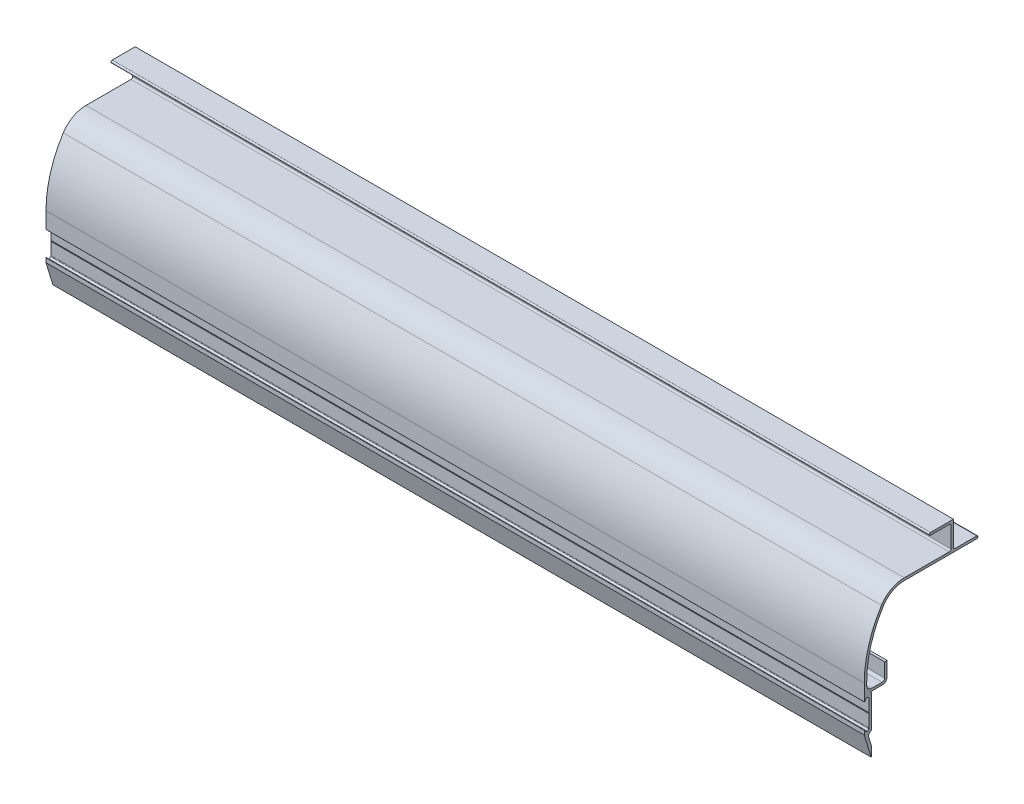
ISO-10303-21;
HEADER;
FILE_DESCRIPTION(('STEP AP214'),'2;1');
FILE_NAME('part.step','',(''),(''),'','','');
FILE_SCHEMA(('AUTOMOTIVE_DESIGN { 1 0 10303 214 1 1 1 1 }'));
ENDSEC;
DATA;
#1=APPLICATION_CONTEXT('core data for automotive mechanical design processes');
#2=APPLICATION_PROTOCOL_DEFINITION('international standard','automotive_design',2000,#1);
#3=PRODUCT_CONTEXT('',#1,'mechanical');
#4=PRODUCT('Part','Part','',(#3));
#5=PRODUCT_RELATED_PRODUCT_CATEGORY('part','',(#4));
#6=PRODUCT_DEFINITION_FORMATION('','',#4);
#7=PRODUCT_DEFINITION_CONTEXT('part definition',#1,'design');
#8=PRODUCT_DEFINITION('design','',#6,#7);
#9=PRODUCT_DEFINITION_SHAPE('','',#8);
#10=(LENGTH_UNIT() NAMED_UNIT(*) SI_UNIT(.MILLI.,.METRE.));
#11=(NAMED_UNIT(*) PLANE_ANGLE_UNIT() SI_UNIT($,.RADIAN.));
#12=(NAMED_UNIT(*) SI_UNIT($,.STERADIAN.) SOLID_ANGLE_UNIT());
#13=UNCERTAINTY_MEASURE_WITH_UNIT(LENGTH_MEASURE(1.E-05),#10,'distance_accuracy_value','');
#14=(GEOMETRIC_REPRESENTATION_CONTEXT(3) GLOBAL_UNCERTAINTY_ASSIGNED_CONTEXT((#13)) GLOBAL_UNIT_ASSIGNED_CONTEXT((#10,
#11,#12)) REPRESENTATION_CONTEXT('',''));
#15=CARTESIAN_POINT('',(0.,0.,0.));
#16=DIRECTION('',(0.,0.,1.));
#17=DIRECTION('',(1.,0.,0.));
#18=AXIS2_PLACEMENT_3D('',#15,#16,#17);
#19=CARTESIAN_POINT('',(500.,136.470436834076,-39.8334983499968));
#20=DIRECTION('',(-1.,0.,0.));
#21=DIRECTION('',(0.,0.,1.));
#22=AXIS2_PLACEMENT_3D('',#19,#20,#21);
#23=CYLINDRICAL_SURFACE('',#22,33.);
#24=CARTESIAN_POINT('',(-500.,136.470436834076,-39.8334983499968));
#25=DIRECTION('',(1.,0.,0.));
#26=DIRECTION('',(0.,0.,-1.));
#27=AXIS2_PLACEMENT_3D('',#24,#25,#26);
#28=CIRCLE('',#27,33.);
#29=CARTESIAN_POINT('',(-500.,169.470436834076,-39.8334983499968));
#30=VERTEX_POINT('',#29);
#31=CARTESIAN_POINT('',(-500.,154.290436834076,-12.0585528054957));
#32=VERTEX_POINT('',#31);
#33=EDGE_CURVE('E380',#30,#32,#28,.T.);
#34=ORIENTED_EDGE('',*,*,#33,.T.);
#35=DIRECTION('',(-1.,0.,0.));
#36=VECTOR('',#35,1.);
#37=CARTESIAN_POINT('',(500.,154.290436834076,-12.0585528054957));
#38=LINE('',#37,#36);
#39=CARTESIAN_POINT('',(500.,154.290436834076,-12.0585528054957));
#40=VERTEX_POINT('',#39);
#41=EDGE_CURVE('E11',#40,#32,#38,.T.);
#42=ORIENTED_EDGE('',*,*,#41,.F.);
#43=CARTESIAN_POINT('',(500.,136.470436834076,-39.8334983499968));
#44=DIRECTION('',(1.,0.,0.));
#45=DIRECTION('',(0.,0.,-1.));
#46=AXIS2_PLACEMENT_3D('',#43,#44,#45);
#47=CIRCLE('',#46,33.);
#48=CARTESIAN_POINT('',(500.,169.470436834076,-39.8334983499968));
#49=VERTEX_POINT('',#48);
#50=EDGE_CURVE('E479',#49,#40,#47,.T.);
#51=ORIENTED_EDGE('',*,*,#50,.F.);
#52=DIRECTION('',(-1.,0.,0.));
#53=VECTOR('',#52,1.);
#54=CARTESIAN_POINT('',(500.,169.470436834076,-39.8334983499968));
#55=LINE('',#54,#53);
#56=EDGE_CURVE('E376',#49,#30,#55,.T.);
#57=ORIENTED_EDGE('',*,*,#56,.T.);
#58=EDGE_LOOP('',(#34,#42,#51,#57));
#59=FACE_BOUND('',#58,.T.);
#60=ADVANCED_FACE('F32',(#59),#23,.T.);
#61=CARTESIAN_POINT('',(500.,82.4704368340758,-124.));
#62=DIRECTION('',(-1.,0.,0.));
#63=DIRECTION('',(0.,0.,1.));
#64=AXIS2_PLACEMENT_3D('',#61,#62,#63);
#65=CYLINDRICAL_SURFACE('',#64,133.);
#66=CARTESIAN_POINT('',(-500.,82.4704368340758,-124.));
#67=DIRECTION('',(1.,0.,0.));
#68=DIRECTION('',(0.,0.,-1.));
#69=AXIS2_PLACEMENT_3D('',#66,#67,#68);
#70=CIRCLE('',#69,133.);
#71=CARTESIAN_POINT('',(-500.,82.4704368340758,9.));
#72=VERTEX_POINT('',#71);
#73=EDGE_CURVE('E383',#32,#72,#70,.T.);
#74=ORIENTED_EDGE('',*,*,#73,.T.);
#75=DIRECTION('',(-1.,0.,0.));
#76=VECTOR('',#75,1.);
#77=CARTESIAN_POINT('',(500.,82.4704368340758,9.));
#78=LINE('',#77,#76);
#79=CARTESIAN_POINT('',(500.,82.4704368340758,9.));
#80=VERTEX_POINT('',#79);
#81=EDGE_CURVE('E40',#80,#72,#78,.T.);
#82=ORIENTED_EDGE('',*,*,#81,.F.);
#83=CARTESIAN_POINT('',(500.,82.4704368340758,-124.));
#84=DIRECTION('',(1.,0.,0.));
#85=DIRECTION('',(0.,0.,-1.));
#86=AXIS2_PLACEMENT_3D('',#83,#84,#85);
#87=CIRCLE('',#86,133.);
#88=EDGE_CURVE('E217',#40,#80,#87,.T.);
#89=ORIENTED_EDGE('',*,*,#88,.F.);
#90=ORIENTED_EDGE('',*,*,#41,.T.);
#91=EDGE_LOOP('',(#74,#82,#89,#90));
#92=FACE_BOUND('',#91,.T.);
#93=ADVANCED_FACE('F747',(#92),#65,.T.);
#94=CARTESIAN_POINT('',(500.,62.6702939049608,9.));
#95=DIRECTION('',(0.,0.,-1.));
#96=DIRECTION('',(-1.,0.,0.));
#97=AXIS2_PLACEMENT_3D('',#94,#95,#96);
#98=PLANE('',#97);
#99=DIRECTION('',(0.,-1.,0.));
#100=VECTOR('',#99,1.);
#101=CARTESIAN_POINT('',(-500.,62.6702939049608,9.));
#102=LINE('',#101,#100);
#103=CARTESIAN_POINT('',(-500.,62.6702939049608,9.00000000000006));
#104=VERTEX_POINT('',#103);
#105=EDGE_CURVE('E385',#72,#104,#102,.T.);
#106=ORIENTED_EDGE('',*,*,#105,.T.);
#107=DIRECTION('',(-1.,0.,0.));
#108=VECTOR('',#107,1.);
#109=CARTESIAN_POINT('',(500.,62.6702939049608,9.00000000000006));
#110=LINE('',#109,#108);
#111=CARTESIAN_POINT('',(500.,62.6702939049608,9.00000000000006));
#112=VERTEX_POINT('',#111);
#113=EDGE_CURVE('E612',#112,#104,#110,.T.);
#114=ORIENTED_EDGE('',*,*,#113,.F.);
#115=DIRECTION('',(0.,-1.,0.));
#116=VECTOR('',#115,1.);
#117=CARTESIAN_POINT('',(500.,62.6702939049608,9.));
#118=LINE('',#117,#116);
#119=EDGE_CURVE('E620',#80,#112,#118,.T.);
#120=ORIENTED_EDGE('',*,*,#119,.F.);
#121=ORIENTED_EDGE('',*,*,#81,.T.);
#122=EDGE_LOOP('',(#106,#114,#120,#121));
#123=FACE_BOUND('',#122,.T.);
#124=ADVANCED_FACE('F618',(#123),#98,.F.);
#125=CARTESIAN_POINT('',(500.,62.6702939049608,8.70000000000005));
#126=DIRECTION('',(-1.,0.,0.));
#127=DIRECTION('',(0.,0.,1.));
#128=AXIS2_PLACEMENT_3D('',#125,#126,#127);
#129=CYLINDRICAL_SURFACE('',#128,0.300000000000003);
#130=CARTESIAN_POINT('',(-500.,62.6702939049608,8.70000000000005));
#131=DIRECTION('',(1.,0.,0.));
#132=DIRECTION('',(0.,0.,-1.));
#133=AXIS2_PLACEMENT_3D('',#130,#131,#132);
#134=CIRCLE('',#133,0.300000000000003);
#135=CARTESIAN_POINT('',(-500.,62.5069021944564,8.44839882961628));
#136=VERTEX_POINT('',#135);
#137=EDGE_CURVE('E387',#104,#136,#134,.T.);
#138=ORIENTED_EDGE('',*,*,#137,.T.);
#139=DIRECTION('',(-1.,0.,0.));
#140=VECTOR('',#139,1.);
#141=CARTESIAN_POINT('',(500.,62.5069021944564,8.44839882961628));
#142=LINE('',#141,#140);
#143=CARTESIAN_POINT('',(500.,62.5069021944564,8.44839882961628));
#144=VERTEX_POINT('',#143);
#145=EDGE_CURVE('E609',#144,#136,#142,.T.);
#146=ORIENTED_EDGE('',*,*,#145,.F.);
#147=CARTESIAN_POINT('',(500.,62.6702939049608,8.70000000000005));
#148=DIRECTION('',(1.,0.,0.));
#149=DIRECTION('',(0.,0.,-1.));
#150=AXIS2_PLACEMENT_3D('',#147,#148,#149);
#151=CIRCLE('',#150,0.300000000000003);
#152=EDGE_CURVE('E638',#112,#144,#151,.T.);
#153=ORIENTED_EDGE('',*,*,#152,.F.);
#154=ORIENTED_EDGE('',*,*,#113,.T.);
#155=EDGE_LOOP('',(#138,#146,#153,#154));
#156=FACE_BOUND('',#155,.T.);
#157=ADVANCED_FACE('F629',(#156),#129,.T.);
#158=CARTESIAN_POINT('',(500.,65.1642605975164,6.72269010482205));
#159=DIRECTION('',(0.,0.544639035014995,0.838670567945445));
#160=DIRECTION('',(0.,-0.838670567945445,0.544639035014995));
#161=AXIS2_PLACEMENT_3D('',#158,#159,#160);
#162=PLANE('',#161);
#163=DIRECTION('',(0.,0.838670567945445,-0.544639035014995));
#164=VECTOR('',#163,1.);
#165=CARTESIAN_POINT('',(-500.,65.1642605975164,6.72269010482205));
#166=LINE('',#165,#164);
#167=CARTESIAN_POINT('',(-500.,65.1642605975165,6.72269010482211));
#168=VERTEX_POINT('',#167);
#169=EDGE_CURVE('E389',#136,#168,#166,.T.);
#170=ORIENTED_EDGE('',*,*,#169,.T.);
#171=DIRECTION('',(-1.,0.,0.));
#172=VECTOR('',#171,1.);
#173=CARTESIAN_POINT('',(500.,65.1642605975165,6.72269010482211));
#174=LINE('',#173,#172);
#175=CARTESIAN_POINT('',(500.,65.1642605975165,6.72269010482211));
#176=VERTEX_POINT('',#175);
#177=EDGE_CURVE('E606',#176,#168,#174,.T.);
#178=ORIENTED_EDGE('',*,*,#177,.F.);
#179=DIRECTION('',(0.,0.838670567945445,-0.544639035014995));
#180=VECTOR('',#179,1.);
#181=CARTESIAN_POINT('',(500.,65.1642605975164,6.72269010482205));
#182=LINE('',#181,#180);
#183=EDGE_CURVE('E635',#144,#176,#182,.T.);
#184=ORIENTED_EDGE('',*,*,#183,.F.);
#185=ORIENTED_EDGE('',*,*,#145,.T.);
#186=EDGE_LOOP('',(#170,#178,#184,#185));
#187=FACE_BOUND('',#186,.T.);
#188=ADVANCED_FACE('F633',(#187),#162,.F.);
#189=CARTESIAN_POINT('',(500.,64.6196215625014,5.88401953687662));
#190=DIRECTION('',(-1.,0.,0.));
#191=DIRECTION('',(0.,0.,1.));
#192=AXIS2_PLACEMENT_3D('',#189,#190,#191);
#193=CYLINDRICAL_SURFACE('',#192,1.00000000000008);
#194=CARTESIAN_POINT('',(-500.,64.6196215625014,5.88401953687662));
#195=DIRECTION('',(-1.,0.,0.));
#196=DIRECTION('',(0.,0.,-1.));
#197=AXIS2_PLACEMENT_3D('',#194,#195,#196);
#198=CIRCLE('',#197,1.00000000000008);
#199=CARTESIAN_POINT('',(-500.,65.4286385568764,5.29623428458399));
#200=VERTEX_POINT('',#199);
#201=EDGE_CURVE('E391',#168,#200,#198,.T.);
#202=ORIENTED_EDGE('',*,*,#201,.T.);
#203=DIRECTION('',(-1.,0.,0.));
#204=VECTOR('',#203,1.);
#205=CARTESIAN_POINT('',(500.,65.4286385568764,5.29623428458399));
#206=LINE('',#205,#204);
#207=CARTESIAN_POINT('',(500.,65.4286385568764,5.29623428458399));
#208=VERTEX_POINT('',#207);
#209=EDGE_CURVE('E603',#208,#200,#206,.T.);
#210=ORIENTED_EDGE('',*,*,#209,.F.);
#211=CARTESIAN_POINT('',(500.,64.6196215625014,5.88401953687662));
#212=DIRECTION('',(-1.,0.,0.));
#213=DIRECTION('',(0.,0.,-1.));
#214=AXIS2_PLACEMENT_3D('',#211,#212,#213);
#215=CIRCLE('',#214,1.00000000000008);
#216=EDGE_CURVE('E637',#176,#208,#215,.T.);
#217=ORIENTED_EDGE('',*,*,#216,.F.);
#218=ORIENTED_EDGE('',*,*,#177,.T.);
#219=EDGE_LOOP('',(#202,#210,#217,#218));
#220=FACE_BOUND('',#219,.T.);
#221=ADVANCED_FACE('F760',(#220),#193,.F.);
#222=CARTESIAN_POINT('',(500.,65.4286385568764,5.29623428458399));
#223=DIRECTION('',(0.,0.80901699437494,-0.587785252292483));
#224=DIRECTION('',(0.,0.587785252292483,0.80901699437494));
#225=AXIS2_PLACEMENT_3D('',#222,#223,#224);
#226=PLANE('',#225);
#227=DIRECTION('',(0.,-0.587785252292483,-0.80901699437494));
#228=VECTOR('',#227,1.);
#229=CARTESIAN_POINT('',(-500.,65.4286385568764,5.29623428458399));
#230=LINE('',#229,#228);
#231=CARTESIAN_POINT('',(-500.,64.0598182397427,3.41221474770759));
#232=VERTEX_POINT('',#231);
#233=EDGE_CURVE('E393',#200,#232,#230,.T.);
#234=ORIENTED_EDGE('',*,*,#233,.T.);
#235=DIRECTION('',(-1.,0.,0.));
#236=VECTOR('',#235,1.);
#237=CARTESIAN_POINT('',(500.,64.0598182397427,3.41221474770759));
#238=LINE('',#237,#236);
#239=CARTESIAN_POINT('',(500.,64.0598182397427,3.41221474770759));
#240=VERTEX_POINT('',#239);
#241=EDGE_CURVE('E600',#240,#232,#238,.T.);
#242=ORIENTED_EDGE('',*,*,#241,.F.);
#243=DIRECTION('',(0.,-0.587785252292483,-0.80901699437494));
#244=VECTOR('',#243,1.);
#245=CARTESIAN_POINT('',(500.,65.4286385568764,5.29623428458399));
#246=LINE('',#245,#244);
#247=EDGE_CURVE('E640',#208,#240,#246,.T.);
#248=ORIENTED_EDGE('',*,*,#247,.F.);
#249=ORIENTED_EDGE('',*,*,#209,.T.);
#250=EDGE_LOOP('',(#234,#242,#248,#249));
#251=FACE_BOUND('',#250,.T.);
#252=ADVANCED_FACE('F763',(#251),#226,.F.);
#253=CARTESIAN_POINT('',(500.,63.2508012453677,4.));
#254=DIRECTION('',(-1.,0.,0.));
#255=DIRECTION('',(0.,0.,1.));
#256=AXIS2_PLACEMENT_3D('',#253,#254,#255);
#257=CYLINDRICAL_SURFACE('',#256,1.);
#258=CARTESIAN_POINT('',(-500.,63.2508012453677,4.));
#259=DIRECTION('',(-1.,0.,0.));
#260=DIRECTION('',(0.,0.,-1.));
#261=AXIS2_PLACEMENT_3D('',#258,#259,#260);
#262=CIRCLE('',#261,1.);
#263=CARTESIAN_POINT('',(-500.,63.2508012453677,3.));
#264=VERTEX_POINT('',#263);
#265=EDGE_CURVE('E395',#232,#264,#262,.T.);
#266=ORIENTED_EDGE('',*,*,#265,.T.);
#267=DIRECTION('',(-1.,0.,0.));
#268=VECTOR('',#267,1.);
#269=CARTESIAN_POINT('',(500.,63.2508012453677,3.));
#270=LINE('',#269,#268);
#271=CARTESIAN_POINT('',(500.,63.2508012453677,3.));
#272=VERTEX_POINT('',#271);
#273=EDGE_CURVE('E597',#272,#264,#270,.T.);
#274=ORIENTED_EDGE('',*,*,#273,.F.);
#275=CARTESIAN_POINT('',(500.,63.2508012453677,4.));
#276=DIRECTION('',(-1.,0.,0.));
#277=DIRECTION('',(0.,0.,-1.));
#278=AXIS2_PLACEMENT_3D('',#275,#276,#277);
#279=CIRCLE('',#278,1.);
#280=EDGE_CURVE('E646',#240,#272,#279,.T.);
#281=ORIENTED_EDGE('',*,*,#280,.F.);
#282=ORIENTED_EDGE('',*,*,#241,.T.);
#283=EDGE_LOOP('',(#266,#274,#281,#282));
#284=FACE_BOUND('',#283,.T.);
#285=ADVANCED_FACE('F767',(#284),#257,.F.);
#286=CARTESIAN_POINT('',(500.,63.2508012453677,3.));
#287=DIRECTION('',(0.,0.,-1.));
#288=DIRECTION('',(-1.,0.,0.));
#289=AXIS2_PLACEMENT_3D('',#286,#287,#288);
#290=PLANE('',#289);
#291=DIRECTION('',(0.,-1.,0.));
#292=VECTOR('',#291,1.);
#293=CARTESIAN_POINT('',(-500.,63.2508012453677,3.));
#294=LINE('',#293,#292);
#295=CARTESIAN_POINT('',(-500.,48.0603266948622,3.));
#296=VERTEX_POINT('',#295);
#297=EDGE_CURVE('E397',#264,#296,#294,.T.);
#298=ORIENTED_EDGE('',*,*,#297,.T.);
#299=DIRECTION('',(-1.,0.,0.));
#300=VECTOR('',#299,1.);
#301=CARTESIAN_POINT('',(500.,48.0603266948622,3.));
#302=LINE('',#301,#300);
#303=CARTESIAN_POINT('',(500.,48.0603266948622,3.));
#304=VERTEX_POINT('',#303);
#305=EDGE_CURVE('E594',#304,#296,#302,.T.);
#306=ORIENTED_EDGE('',*,*,#305,.F.);
#307=DIRECTION('',(0.,-1.,0.));
#308=VECTOR('',#307,1.);
#309=CARTESIAN_POINT('',(500.,63.2508012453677,3.));
#310=LINE('',#309,#308);
#311=EDGE_CURVE('E648',#272,#304,#310,.T.);
#312=ORIENTED_EDGE('',*,*,#311,.F.);
#313=ORIENTED_EDGE('',*,*,#273,.T.);
#314=EDGE_LOOP('',(#298,#306,#312,#313));
#315=FACE_BOUND('',#314,.T.);
#316=ADVANCED_FACE('F771',(#315),#290,.F.);
#317=CARTESIAN_POINT('',(500.,47.5603266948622,2.5));
#318=DIRECTION('',(0.,0.707106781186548,-0.707106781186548));
#319=DIRECTION('',(0.,0.707106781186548,0.707106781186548));
#320=AXIS2_PLACEMENT_3D('',#317,#318,#319);
#321=PLANE('',#320);
#322=DIRECTION('',(0.,-0.707106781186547,-0.707106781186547));
#323=VECTOR('',#322,1.);
#324=CARTESIAN_POINT('',(-500.,47.5603266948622,2.5));
#325=LINE('',#324,#323);
#326=CARTESIAN_POINT('',(-500.,47.5603266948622,2.5));
#327=VERTEX_POINT('',#326);
#328=EDGE_CURVE('E399',#296,#327,#325,.T.);
#329=ORIENTED_EDGE('',*,*,#328,.T.);
#330=DIRECTION('',(-1.,0.,0.));
#331=VECTOR('',#330,1.);
#332=CARTESIAN_POINT('',(500.,47.5603266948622,2.5));
#333=LINE('',#332,#331);
#334=CARTESIAN_POINT('',(500.,47.5603266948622,2.5));
#335=VERTEX_POINT('',#334);
#336=EDGE_CURVE('E591',#335,#327,#333,.T.);
#337=ORIENTED_EDGE('',*,*,#336,.F.);
#338=DIRECTION('',(0.,-0.707106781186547,-0.707106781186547));
#339=VECTOR('',#338,1.);
#340=CARTESIAN_POINT('',(500.,47.5603266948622,2.5));
#341=LINE('',#340,#339);
#342=EDGE_CURVE('E650',#304,#335,#341,.T.);
#343=ORIENTED_EDGE('',*,*,#342,.F.);
#344=ORIENTED_EDGE('',*,*,#305,.T.);
#345=EDGE_LOOP('',(#329,#337,#343,#344));
#346=FACE_BOUND('',#345,.T.);
#347=ADVANCED_FACE('F775',(#346),#321,.F.);
#348=CARTESIAN_POINT('',(500.,47.0603266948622,3.));
#349=DIRECTION('',(0.,-0.707106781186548,-0.707106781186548));
#350=DIRECTION('',(0.,0.707106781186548,-0.707106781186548));
#351=AXIS2_PLACEMENT_3D('',#348,#349,#350);
#352=PLANE('',#351);
#353=DIRECTION('',(0.,-0.707106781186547,0.707106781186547));
#354=VECTOR('',#353,1.);
#355=CARTESIAN_POINT('',(-500.,47.0603266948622,3.));
#356=LINE('',#355,#354);
#357=CARTESIAN_POINT('',(-500.,47.0603266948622,3.));
#358=VERTEX_POINT('',#357);
#359=EDGE_CURVE('E401',#327,#358,#356,.T.);
#360=ORIENTED_EDGE('',*,*,#359,.T.);
#361=DIRECTION('',(-1.,0.,0.));
#362=VECTOR('',#361,1.);
#363=CARTESIAN_POINT('',(500.,47.0603266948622,3.));
#364=LINE('',#363,#362);
#365=CARTESIAN_POINT('',(500.,47.0603266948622,3.));
#366=VERTEX_POINT('',#365);
#367=EDGE_CURVE('E588',#366,#358,#364,.T.);
#368=ORIENTED_EDGE('',*,*,#367,.F.);
#369=DIRECTION('',(0.,-0.707106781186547,0.707106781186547));
#370=VECTOR('',#369,1.);
#371=CARTESIAN_POINT('',(500.,47.0603266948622,3.));
#372=LINE('',#371,#370);
#373=EDGE_CURVE('E652',#335,#366,#372,.T.);
#374=ORIENTED_EDGE('',*,*,#373,.F.);
#375=ORIENTED_EDGE('',*,*,#336,.T.);
#376=EDGE_LOOP('',(#360,#368,#374,#375));
#377=FACE_BOUND('',#376,.T.);
#378=ADVANCED_FACE('F779',(#377),#352,.F.);
#379=CARTESIAN_POINT('',(500.,47.0603266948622,3.));
#380=DIRECTION('',(0.,0.,-1.));
#381=DIRECTION('',(-1.,0.,0.));
#382=AXIS2_PLACEMENT_3D('',#379,#380,#381);
#383=PLANE('',#382);
#384=DIRECTION('',(0.,-1.,0.));
#385=VECTOR('',#384,1.);
#386=CARTESIAN_POINT('',(-500.,47.0603266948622,3.));
#387=LINE('',#386,#385);
#388=CARTESIAN_POINT('',(-500.,31.8698521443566,2.99999999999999));
#389=VERTEX_POINT('',#388);
#390=EDGE_CURVE('E403',#358,#389,#387,.T.);
#391=ORIENTED_EDGE('',*,*,#390,.T.);
#392=DIRECTION('',(-1.,0.,0.));
#393=VECTOR('',#392,1.);
#394=CARTESIAN_POINT('',(500.,31.8698521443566,2.99999999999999));
#395=LINE('',#394,#393);
#396=CARTESIAN_POINT('',(500.,31.8698521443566,2.99999999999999));
#397=VERTEX_POINT('',#396);
#398=EDGE_CURVE('E585',#397,#389,#395,.T.);
#399=ORIENTED_EDGE('',*,*,#398,.F.);
#400=DIRECTION('',(0.,-1.,0.));
#401=VECTOR('',#400,1.);
#402=CARTESIAN_POINT('',(500.,47.0603266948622,3.));
#403=LINE('',#402,#401);
#404=EDGE_CURVE('E654',#366,#397,#403,.T.);
#405=ORIENTED_EDGE('',*,*,#404,.F.);
#406=ORIENTED_EDGE('',*,*,#367,.T.);
#407=EDGE_LOOP('',(#391,#399,#405,#406));
#408=FACE_BOUND('',#407,.T.);
#409=ADVANCED_FACE('F783',(#408),#383,.F.);
#410=CARTESIAN_POINT('',(500.,31.8698521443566,4.));
#411=DIRECTION('',(-1.,0.,0.));
#412=DIRECTION('',(0.,0.,1.));
#413=AXIS2_PLACEMENT_3D('',#410,#411,#412);
#414=CYLINDRICAL_SURFACE('',#413,1.00000000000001);
#415=CARTESIAN_POINT('',(-500.,31.8698521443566,4.));
#416=DIRECTION('',(-1.,0.,0.));
#417=DIRECTION('',(0.,0.,-1.));
#418=AXIS2_PLACEMENT_3D('',#415,#416,#417);
#419=CIRCLE('',#418,1.00000000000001);
#420=CARTESIAN_POINT('',(-500.,31.0608351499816,3.41221474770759));
#421=VERTEX_POINT('',#420);
#422=EDGE_CURVE('E405',#389,#421,#419,.T.);
#423=ORIENTED_EDGE('',*,*,#422,.T.);
#424=DIRECTION('',(-1.,0.,0.));
#425=VECTOR('',#424,1.);
#426=CARTESIAN_POINT('',(500.,31.0608351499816,3.41221474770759));
#427=LINE('',#426,#425);
#428=CARTESIAN_POINT('',(500.,31.0608351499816,3.41221474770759));
#429=VERTEX_POINT('',#428);
#430=EDGE_CURVE('E582',#429,#421,#427,.T.);
#431=ORIENTED_EDGE('',*,*,#430,.F.);
#432=CARTESIAN_POINT('',(500.,31.8698521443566,4.));
#433=DIRECTION('',(-1.,0.,0.));
#434=DIRECTION('',(0.,0.,-1.));
#435=AXIS2_PLACEMENT_3D('',#432,#433,#434);
#436=CIRCLE('',#435,1.00000000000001);
#437=EDGE_CURVE('E656',#397,#429,#436,.T.);
#438=ORIENTED_EDGE('',*,*,#437,.F.);
#439=ORIENTED_EDGE('',*,*,#398,.T.);
#440=EDGE_LOOP('',(#423,#431,#438,#439));
#441=FACE_BOUND('',#440,.T.);
#442=ADVANCED_FACE('F787',(#441),#414,.F.);
#443=CARTESIAN_POINT('',(500.,31.0608351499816,3.41221474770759));
#444=DIRECTION('',(0.,-0.809016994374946,-0.587785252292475));
#445=DIRECTION('',(0.,0.587785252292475,-0.809016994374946));
#446=AXIS2_PLACEMENT_3D('',#443,#444,#445);
#447=PLANE('',#446);
#448=DIRECTION('',(0.,-0.587785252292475,0.809016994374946));
#449=VECTOR('',#448,1.);
#450=CARTESIAN_POINT('',(-500.,31.0608351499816,3.41221474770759));
#451=LINE('',#450,#449);
#452=CARTESIAN_POINT('',(-500.,29.692014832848,5.29623428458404));
#453=VERTEX_POINT('',#452);
#454=EDGE_CURVE('E407',#421,#453,#451,.T.);
#455=ORIENTED_EDGE('',*,*,#454,.T.);
#456=DIRECTION('',(-1.,0.,0.));
#457=VECTOR('',#456,1.);
#458=CARTESIAN_POINT('',(500.,29.692014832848,5.29623428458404));
#459=LINE('',#458,#457);
#460=CARTESIAN_POINT('',(500.,29.692014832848,5.29623428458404));
#461=VERTEX_POINT('',#460);
#462=EDGE_CURVE('E579',#461,#453,#459,.T.);
#463=ORIENTED_EDGE('',*,*,#462,.F.);
#464=DIRECTION('',(0.,-0.587785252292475,0.809016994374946));
#465=VECTOR('',#464,1.);
#466=CARTESIAN_POINT('',(500.,31.0608351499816,3.41221474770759));
#467=LINE('',#466,#465);
#468=EDGE_CURVE('E658',#429,#461,#467,.T.);
#469=ORIENTED_EDGE('',*,*,#468,.F.);
#470=ORIENTED_EDGE('',*,*,#430,.T.);
#471=EDGE_LOOP('',(#455,#463,#469,#470));
#472=FACE_BOUND('',#471,.T.);
#473=ADVANCED_FACE('F791',(#472),#447,.F.);
#474=CARTESIAN_POINT('',(500.,30.501031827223,5.88401953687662));
#475=DIRECTION('',(-1.,0.,0.));
#476=DIRECTION('',(0.,0.,1.));
#477=AXIS2_PLACEMENT_3D('',#474,#475,#476);
#478=CYLINDRICAL_SURFACE('',#477,1.0000000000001);
#479=CARTESIAN_POINT('',(-500.,30.501031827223,5.88401953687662));
#480=DIRECTION('',(-1.,0.,0.));
#481=DIRECTION('',(0.,0.,-1.));
#482=AXIS2_PLACEMENT_3D('',#479,#480,#481);
#483=CIRCLE('',#482,1.0000000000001);
#484=CARTESIAN_POINT('',(-500.,29.9563927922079,6.72269010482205));
#485=VERTEX_POINT('',#484);
#486=EDGE_CURVE('E409',#453,#485,#483,.T.);
#487=ORIENTED_EDGE('',*,*,#486,.T.);
#488=DIRECTION('',(-1.,0.,0.));
#489=VECTOR('',#488,1.);
#490=CARTESIAN_POINT('',(500.,29.9563927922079,6.72269010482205));
#491=LINE('',#490,#489);
#492=CARTESIAN_POINT('',(500.,29.9563927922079,6.72269010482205));
#493=VERTEX_POINT('',#492);
#494=EDGE_CURVE('E576',#493,#485,#491,.T.);
#495=ORIENTED_EDGE('',*,*,#494,.F.);
#496=CARTESIAN_POINT('',(500.,30.501031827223,5.88401953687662));
#497=DIRECTION('',(-1.,0.,0.));
#498=DIRECTION('',(0.,0.,-1.));
#499=AXIS2_PLACEMENT_3D('',#496,#497,#498);
#500=CIRCLE('',#499,1.0000000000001);
#501=EDGE_CURVE('E660',#461,#493,#500,.T.);
#502=ORIENTED_EDGE('',*,*,#501,.F.);
#503=ORIENTED_EDGE('',*,*,#462,.T.);
#504=EDGE_LOOP('',(#487,#495,#502,#503));
#505=FACE_BOUND('',#504,.T.);
#506=ADVANCED_FACE('F795',(#505),#478,.F.);
#507=CARTESIAN_POINT('',(500.,32.6137511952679,8.44839882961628));
#508=DIRECTION('',(0.,-0.544639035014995,0.838670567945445));
#509=DIRECTION('',(0.,-0.838670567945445,-0.544639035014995));
#510=AXIS2_PLACEMENT_3D('',#507,#508,#509);
#511=PLANE('',#510);
#512=DIRECTION('',(0.,0.838670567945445,0.544639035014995));
#513=VECTOR('',#512,1.);
#514=CARTESIAN_POINT('',(-500.,32.6137511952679,8.44839882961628));
#515=LINE('',#514,#513);
#516=CARTESIAN_POINT('',(-500.,32.6137511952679,8.44839882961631));
#517=VERTEX_POINT('',#516);
#518=EDGE_CURVE('E411',#485,#517,#515,.T.);
#519=ORIENTED_EDGE('',*,*,#518,.T.);
#520=DIRECTION('',(-1.,0.,0.));
#521=VECTOR('',#520,1.);
#522=CARTESIAN_POINT('',(500.,32.6137511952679,8.44839882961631));
#523=LINE('',#522,#521);
#524=CARTESIAN_POINT('',(500.,32.6137511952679,8.44839882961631));
#525=VERTEX_POINT('',#524);
#526=EDGE_CURVE('E573',#525,#517,#523,.T.);
#527=ORIENTED_EDGE('',*,*,#526,.F.);
#528=DIRECTION('',(0.,0.838670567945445,0.544639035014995));
#529=VECTOR('',#528,1.);
#530=CARTESIAN_POINT('',(500.,32.6137511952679,8.44839882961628));
#531=LINE('',#530,#529);
#532=EDGE_CURVE('E662',#493,#525,#531,.T.);
#533=ORIENTED_EDGE('',*,*,#532,.F.);
#534=ORIENTED_EDGE('',*,*,#494,.T.);
#535=EDGE_LOOP('',(#519,#527,#533,#534));
#536=FACE_BOUND('',#535,.T.);
#537=ADVANCED_FACE('F799',(#536),#511,.F.);
#538=CARTESIAN_POINT('',(500.,32.4503594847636,8.70000000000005));
#539=DIRECTION('',(-1.,0.,0.));
#540=DIRECTION('',(0.,0.,1.));
#541=AXIS2_PLACEMENT_3D('',#538,#539,#540);
#542=CYLINDRICAL_SURFACE('',#541,0.299999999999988);
#543=CARTESIAN_POINT('',(-500.,32.4503594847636,8.70000000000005));
#544=DIRECTION('',(1.,0.,0.));
#545=DIRECTION('',(0.,0.,-1.));
#546=AXIS2_PLACEMENT_3D('',#543,#544,#545);
#547=CIRCLE('',#546,0.299999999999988);
#548=CARTESIAN_POINT('',(-500.,32.4503594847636,9.));
#549=VERTEX_POINT('',#548);
#550=EDGE_CURVE('E413',#517,#549,#547,.T.);
#551=ORIENTED_EDGE('',*,*,#550,.T.);
#552=DIRECTION('',(-1.,0.,0.));
#553=VECTOR('',#552,1.);
#554=CARTESIAN_POINT('',(500.,32.4503594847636,9.));
#555=LINE('',#554,#553);
#556=CARTESIAN_POINT('',(500.,32.4503594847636,9.));
#557=VERTEX_POINT('',#556);
#558=EDGE_CURVE('E570',#557,#549,#555,.T.);
#559=ORIENTED_EDGE('',*,*,#558,.F.);
#560=CARTESIAN_POINT('',(500.,32.4503594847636,8.70000000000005));
#561=DIRECTION('',(1.,0.,0.));
#562=DIRECTION('',(0.,0.,-1.));
#563=AXIS2_PLACEMENT_3D('',#560,#561,#562);
#564=CIRCLE('',#563,0.299999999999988);
#565=EDGE_CURVE('E664',#525,#557,#564,.T.);
#566=ORIENTED_EDGE('',*,*,#565,.F.);
#567=ORIENTED_EDGE('',*,*,#526,.T.);
#568=EDGE_LOOP('',(#551,#559,#566,#567));
#569=FACE_BOUND('',#568,.T.);
#570=ADVANCED_FACE('F803',(#569),#542,.T.);
#571=CARTESIAN_POINT('',(500.,27.4303266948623,9.));
#572=DIRECTION('',(0.,0.,-1.));
#573=DIRECTION('',(-1.,0.,0.));
#574=AXIS2_PLACEMENT_3D('',#571,#572,#573);
#575=PLANE('',#574);
#576=DIRECTION('',(0.,-1.,0.));
#577=VECTOR('',#576,1.);
#578=CARTESIAN_POINT('',(-500.,27.4303266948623,9.));
#579=LINE('',#578,#577);
#580=CARTESIAN_POINT('',(-500.,27.4303266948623,9.));
#581=VERTEX_POINT('',#580);
#582=EDGE_CURVE('E415',#549,#581,#579,.T.);
#583=ORIENTED_EDGE('',*,*,#582,.T.);
#584=DIRECTION('',(-1.,0.,0.));
#585=VECTOR('',#584,1.);
#586=CARTESIAN_POINT('',(500.,27.4303266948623,9.));
#587=LINE('',#586,#585);
#588=CARTESIAN_POINT('',(500.,27.4303266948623,9.));
#589=VERTEX_POINT('',#588);
#590=EDGE_CURVE('E567',#589,#581,#587,.T.);
#591=ORIENTED_EDGE('',*,*,#590,.F.);
#592=DIRECTION('',(0.,-1.,0.));
#593=VECTOR('',#592,1.);
#594=CARTESIAN_POINT('',(500.,27.4303266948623,9.));
#595=LINE('',#594,#593);
#596=EDGE_CURVE('E666',#557,#589,#595,.T.);
#597=ORIENTED_EDGE('',*,*,#596,.F.);
#598=ORIENTED_EDGE('',*,*,#558,.T.);
#599=EDGE_LOOP('',(#583,#591,#597,#598));
#600=FACE_BOUND('',#599,.T.);
#601=ADVANCED_FACE('F807',(#600),#575,.F.);
#602=CARTESIAN_POINT('',(500.,-0.0877115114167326,0.58689142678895));
#603=DIRECTION('',(0.,0.292371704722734,-0.956304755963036));
#604=DIRECTION('',(0.,0.956304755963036,0.292371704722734));
#605=AXIS2_PLACEMENT_3D('',#602,#603,#604);
#606=PLANE('',#605);
#607=DIRECTION('',(0.,-0.956304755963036,-0.292371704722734));
#608=VECTOR('',#607,1.);
#609=CARTESIAN_POINT('',(-500.,-0.0877115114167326,0.58689142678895));
#610=LINE('',#609,#608);
#611=CARTESIAN_POINT('',(-500.,-0.0877115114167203,0.58689142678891));
#612=VERTEX_POINT('',#611);
#613=EDGE_CURVE('E417',#581,#612,#610,.T.);
#614=ORIENTED_EDGE('',*,*,#613,.T.);
#615=DIRECTION('',(-1.,0.,0.));
#616=VECTOR('',#615,1.);
#617=CARTESIAN_POINT('',(500.,-0.0877115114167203,0.58689142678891));
#618=LINE('',#617,#616);
#619=CARTESIAN_POINT('',(500.,-0.0877115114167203,0.58689142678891));
#620=VERTEX_POINT('',#619);
#621=EDGE_CURVE('E564',#620,#612,#618,.T.);
#622=ORIENTED_EDGE('',*,*,#621,.F.);
#623=DIRECTION('',(0.,-0.956304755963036,-0.292371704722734));
#624=VECTOR('',#623,1.);
#625=CARTESIAN_POINT('',(500.,-0.0877115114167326,0.58689142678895));
#626=LINE('',#625,#624);
#627=EDGE_CURVE('E668',#589,#620,#626,.T.);
#628=ORIENTED_EDGE('',*,*,#627,.F.);
#629=ORIENTED_EDGE('',*,*,#590,.T.);
#630=EDGE_LOOP('',(#614,#622,#628,#629));
#631=FACE_BOUND('',#630,.T.);
#632=ADVANCED_FACE('F811',(#631),#606,.F.);
#633=CARTESIAN_POINT('',(500.,0.,0.299999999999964));
#634=DIRECTION('',(-1.,0.,0.));
#635=DIRECTION('',(0.,0.,1.));
#636=AXIS2_PLACEMENT_3D('',#633,#634,#635);
#637=CYLINDRICAL_SURFACE('',#636,0.300000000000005);
#638=CARTESIAN_POINT('',(-500.,0.,0.299999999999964));
#639=DIRECTION('',(1.,0.,0.));
#640=DIRECTION('',(0.,0.,-1.));
#641=AXIS2_PLACEMENT_3D('',#638,#639,#640);
#642=CIRCLE('',#641,0.300000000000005);
#643=CARTESIAN_POINT('',(-500.,0.,0.));
#644=VERTEX_POINT('',#643);
#645=EDGE_CURVE('E419',#612,#644,#642,.T.);
#646=ORIENTED_EDGE('',*,*,#645,.T.);
#647=DIRECTION('',(-1.,0.,0.));
#648=VECTOR('',#647,1.);
#649=CARTESIAN_POINT('',(500.,0.,0.));
#650=LINE('',#649,#648);
#651=CARTESIAN_POINT('',(500.,0.,0.));
#652=VERTEX_POINT('',#651);
#653=EDGE_CURVE('E561',#652,#644,#650,.T.);
#654=ORIENTED_EDGE('',*,*,#653,.F.);
#655=CARTESIAN_POINT('',(500.,0.,0.299999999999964));
#656=DIRECTION('',(1.,0.,0.));
#657=DIRECTION('',(0.,0.,-1.));
#658=AXIS2_PLACEMENT_3D('',#655,#656,#657);
#659=CIRCLE('',#658,0.300000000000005);
#660=EDGE_CURVE('E670',#620,#652,#659,.T.);
#661=ORIENTED_EDGE('',*,*,#660,.F.);
#662=ORIENTED_EDGE('',*,*,#621,.T.);
#663=EDGE_LOOP('',(#646,#654,#661,#662));
#664=FACE_BOUND('',#663,.T.);
#665=ADVANCED_FACE('F815',(#664),#637,.T.);
#666=CARTESIAN_POINT('',(500.,11.1242509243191,0.));
#667=DIRECTION('',(0.,0.,1.));
#668=DIRECTION('',(1.,0.,0.));
#669=AXIS2_PLACEMENT_3D('',#666,#667,#668);
#670=PLANE('',#669);
#671=DIRECTION('',(0.,1.,0.));
#672=VECTOR('',#671,1.);
#673=CARTESIAN_POINT('',(-500.,11.1242509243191,0.));
#674=LINE('',#673,#672);
#675=CARTESIAN_POINT('',(-500.,11.1242509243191,0.));
#676=VERTEX_POINT('',#675);
#677=EDGE_CURVE('E421',#644,#676,#674,.T.);
#678=ORIENTED_EDGE('',*,*,#677,.T.);
#679=DIRECTION('',(-1.,0.,0.));
#680=VECTOR('',#679,1.);
#681=CARTESIAN_POINT('',(500.,11.1242509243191,0.));
#682=LINE('',#681,#680);
#683=CARTESIAN_POINT('',(500.,11.1242509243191,0.));
#684=VERTEX_POINT('',#683);
#685=EDGE_CURVE('E558',#684,#676,#682,.T.);
#686=ORIENTED_EDGE('',*,*,#685,.F.);
#687=DIRECTION('',(0.,1.,0.));
#688=VECTOR('',#687,1.);
#689=CARTESIAN_POINT('',(500.,11.1242509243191,0.));
#690=LINE('',#689,#688);
#691=EDGE_CURVE('E672',#652,#684,#690,.T.);
#692=ORIENTED_EDGE('',*,*,#691,.F.);
#693=ORIENTED_EDGE('',*,*,#653,.T.);
#694=EDGE_LOOP('',(#678,#686,#692,#693));
#695=FACE_BOUND('',#694,.T.);
#696=ADVANCED_FACE('F819',(#695),#670,.F.);
#697=CARTESIAN_POINT('',(500.,23.2423202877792,3.70486560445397));
#698=DIRECTION('',(0.,-0.292371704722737,0.956304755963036));
#699=DIRECTION('',(0.,-0.956304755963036,-0.292371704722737));
#700=AXIS2_PLACEMENT_3D('',#697,#698,#699);
#701=PLANE('',#700);
#702=DIRECTION('',(0.,0.956304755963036,0.292371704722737));
#703=VECTOR('',#702,1.);
#704=CARTESIAN_POINT('',(-500.,23.2423202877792,3.70486560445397));
#705=LINE('',#704,#703);
#706=CARTESIAN_POINT('',(-500.,23.2423202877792,3.70486560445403));
#707=VERTEX_POINT('',#706);
#708=EDGE_CURVE('E423',#676,#707,#705,.T.);
#709=ORIENTED_EDGE('',*,*,#708,.T.);
#710=DIRECTION('',(-1.,0.,0.));
#711=VECTOR('',#710,1.);
#712=CARTESIAN_POINT('',(500.,23.2423202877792,3.70486560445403));
#713=LINE('',#712,#711);
#714=CARTESIAN_POINT('',(500.,23.2423202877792,3.70486560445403));
#715=VERTEX_POINT('',#714);
#716=EDGE_CURVE('E555',#715,#707,#713,.T.);
#717=ORIENTED_EDGE('',*,*,#716,.F.);
#718=DIRECTION('',(0.,0.956304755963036,0.292371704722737));
#719=VECTOR('',#718,1.);
#720=CARTESIAN_POINT('',(500.,23.2423202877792,3.70486560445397));
#721=LINE('',#720,#719);
#722=EDGE_CURVE('E674',#684,#715,#721,.T.);
#723=ORIENTED_EDGE('',*,*,#722,.F.);
#724=ORIENTED_EDGE('',*,*,#685,.T.);
#725=EDGE_LOOP('',(#709,#717,#723,#724));
#726=FACE_BOUND('',#725,.T.);
#727=ADVANCED_FACE('F823',(#726),#701,.F.);
#728=CARTESIAN_POINT('',(500.,24.1194354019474,0.835951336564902));
#729=DIRECTION('',(-1.,0.,0.));
#730=DIRECTION('',(0.,0.,1.));
#731=AXIS2_PLACEMENT_3D('',#728,#729,#730);
#732=CYLINDRICAL_SURFACE('',#731,3.00000000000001);
#733=CARTESIAN_POINT('',(-500.,24.1194354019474,0.835951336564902));
#734=DIRECTION('',(-1.,0.,0.));
#735=DIRECTION('',(0.,0.,-1.));
#736=AXIS2_PLACEMENT_3D('',#733,#734,#735);
#737=CIRCLE('',#736,3.00000000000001);
#738=CARTESIAN_POINT('',(-500.,26.5464863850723,2.59930709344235));
#739=VERTEX_POINT('',#738);
#740=EDGE_CURVE('E425',#707,#739,#737,.T.);
#741=ORIENTED_EDGE('',*,*,#740,.T.);
#742=DIRECTION('',(-1.,0.,0.));
#743=VECTOR('',#742,1.);
#744=CARTESIAN_POINT('',(500.,26.5464863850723,2.59930709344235));
#745=LINE('',#744,#743);
#746=CARTESIAN_POINT('',(500.,26.5464863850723,2.59930709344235));
#747=VERTEX_POINT('',#746);
#748=EDGE_CURVE('E552',#747,#739,#745,.T.);
#749=ORIENTED_EDGE('',*,*,#748,.F.);
#750=CARTESIAN_POINT('',(500.,24.1194354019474,0.835951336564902));
#751=DIRECTION('',(-1.,0.,0.));
#752=DIRECTION('',(0.,0.,-1.));
#753=AXIS2_PLACEMENT_3D('',#750,#751,#752);
#754=CIRCLE('',#753,3.00000000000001);
#755=EDGE_CURVE('E676',#715,#747,#754,.T.);
#756=ORIENTED_EDGE('',*,*,#755,.F.);
#757=ORIENTED_EDGE('',*,*,#716,.T.);
#758=EDGE_LOOP('',(#741,#749,#756,#757));
#759=FACE_BOUND('',#758,.T.);
#760=ADVANCED_FACE('F827',(#759),#732,.F.);
#761=CARTESIAN_POINT('',(500.,28.4349935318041,0.));
#762=DIRECTION('',(0.,0.809016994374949,0.587785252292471));
#763=DIRECTION('',(0.,-0.587785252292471,0.809016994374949));
#764=AXIS2_PLACEMENT_3D('',#761,#762,#763);
#765=PLANE('',#764);
#766=DIRECTION('',(0.,0.587785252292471,-0.809016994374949));
#767=VECTOR('',#766,1.);
#768=CARTESIAN_POINT('',(-500.,28.4349935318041,0.));
#769=LINE('',#768,#767);
#770=CARTESIAN_POINT('',(-500.,28.4349935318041,0.));
#771=VERTEX_POINT('',#770);
#772=EDGE_CURVE('E427',#739,#771,#769,.T.);
#773=ORIENTED_EDGE('',*,*,#772,.T.);
#774=DIRECTION('',(-1.,0.,0.));
#775=VECTOR('',#774,1.);
#776=CARTESIAN_POINT('',(500.,28.4349935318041,0.));
#777=LINE('',#776,#775);
#778=CARTESIAN_POINT('',(500.,28.4349935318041,0.));
#779=VERTEX_POINT('',#778);
#780=EDGE_CURVE('E549',#779,#771,#777,.T.);
#781=ORIENTED_EDGE('',*,*,#780,.F.);
#782=DIRECTION('',(0.,0.587785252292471,-0.809016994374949));
#783=VECTOR('',#782,1.);
#784=CARTESIAN_POINT('',(500.,28.4349935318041,0.));
#785=LINE('',#784,#783);
#786=EDGE_CURVE('E678',#747,#779,#785,.T.);
#787=ORIENTED_EDGE('',*,*,#786,.F.);
#788=ORIENTED_EDGE('',*,*,#748,.T.);
#789=EDGE_LOOP('',(#773,#781,#787,#788));
#790=FACE_BOUND('',#789,.T.);
#791=ADVANCED_FACE('F831',(#790),#765,.F.);
#792=CARTESIAN_POINT('',(500.,67.7610389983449,0.));
#793=DIRECTION('',(0.,0.,1.));
#794=DIRECTION('',(1.,0.,0.));
#795=AXIS2_PLACEMENT_3D('',#792,#793,#794);
#796=PLANE('',#795);
#797=DIRECTION('',(0.,1.,0.));
#798=VECTOR('',#797,1.);
#799=CARTESIAN_POINT('',(-500.,67.7610389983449,0.));
#800=LINE('',#799,#798);
#801=CARTESIAN_POINT('',(-500.,67.7610389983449,0.));
#802=VERTEX_POINT('',#801);
#803=EDGE_CURVE('E430',#771,#802,#800,.T.);
#804=ORIENTED_EDGE('',*,*,#803,.T.);
#805=DIRECTION('',(-1.,0.,0.));
#806=VECTOR('',#805,1.);
#807=CARTESIAN_POINT('',(500.,67.7610389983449,0.));
#808=LINE('',#807,#806);
#809=CARTESIAN_POINT('',(500.,67.7610389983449,0.));
#810=VERTEX_POINT('',#809);
#811=EDGE_CURVE('E546',#810,#802,#808,.T.);
#812=ORIENTED_EDGE('',*,*,#811,.F.);
#813=DIRECTION('',(0.,1.,0.));
#814=VECTOR('',#813,1.);
#815=CARTESIAN_POINT('',(500.,47.5603266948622,0.));
#816=LINE('',#815,#814);
#817=EDGE_CURVE('E680',#779,#810,#816,.T.);
#818=ORIENTED_EDGE('',*,*,#817,.F.);
#819=ORIENTED_EDGE('',*,*,#780,.T.);
#820=EDGE_LOOP('',(#804,#812,#818,#819));
#821=FACE_BOUND('',#820,.T.);
#822=ADVANCED_FACE('F835',(#821),#796,.F.);
#823=CARTESIAN_POINT('',(500.,68.5363749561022,1.06715839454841));
#824=DIRECTION('',(0.,-0.809016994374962,0.587785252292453));
#825=DIRECTION('',(0.,-0.587785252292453,-0.809016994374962));
#826=AXIS2_PLACEMENT_3D('',#823,#824,#825);
#827=PLANE('',#826);
#828=DIRECTION('',(0.,0.587785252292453,0.809016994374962));
#829=VECTOR('',#828,1.);
#830=CARTESIAN_POINT('',(-500.,68.5363749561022,1.06715839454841));
#831=LINE('',#830,#829);
#832=CARTESIAN_POINT('',(-500.,68.5363749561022,1.06715839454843));
#833=VERTEX_POINT('',#832);
#834=EDGE_CURVE('E432',#802,#833,#831,.T.);
#835=ORIENTED_EDGE('',*,*,#834,.T.);
#836=DIRECTION('',(-1.,0.,0.));
#837=VECTOR('',#836,1.);
#838=CARTESIAN_POINT('',(500.,68.5363749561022,1.06715839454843));
#839=LINE('',#838,#837);
#840=CARTESIAN_POINT('',(500.,68.5363749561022,1.06715839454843));
#841=VERTEX_POINT('',#840);
#842=EDGE_CURVE('E543',#841,#833,#839,.T.);
#843=ORIENTED_EDGE('',*,*,#842,.F.);
#844=DIRECTION('',(0.,0.587785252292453,0.809016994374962));
#845=VECTOR('',#844,1.);
#846=CARTESIAN_POINT('',(500.,68.5363749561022,1.06715839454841));
#847=LINE('',#846,#845);
#848=EDGE_CURVE('E682',#810,#841,#847,.T.);
#849=ORIENTED_EDGE('',*,*,#848,.F.);
#850=ORIENTED_EDGE('',*,*,#811,.T.);
#851=EDGE_LOOP('',(#835,#843,#849,#850));
#852=FACE_BOUND('',#851,.T.);
#853=ADVANCED_FACE('F839',(#852),#827,.F.);
#854=CARTESIAN_POINT('',(500.,68.9541001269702,0.763663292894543));
#855=DIRECTION('',(-1.,0.,0.));
#856=DIRECTION('',(0.,0.,1.));
#857=AXIS2_PLACEMENT_3D('',#854,#855,#856);
#858=CYLINDRICAL_SURFACE('',#857,0.516336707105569);
#859=CARTESIAN_POINT('',(-500.,68.9541001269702,0.763663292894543));
#860=DIRECTION('',(-1.,0.,0.));
#861=DIRECTION('',(0.,0.,-1.));
#862=AXIS2_PLACEMENT_3D('',#859,#860,#861);
#863=CIRCLE('',#862,0.516336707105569);
#864=CARTESIAN_POINT('',(-500.,69.4704368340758,0.763663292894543));
#865=VERTEX_POINT('',#864);
#866=EDGE_CURVE('E434',#833,#865,#863,.T.);
#867=ORIENTED_EDGE('',*,*,#866,.T.);
#868=DIRECTION('',(-1.,0.,0.));
#869=VECTOR('',#868,1.);
#870=CARTESIAN_POINT('',(500.,69.4704368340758,0.763663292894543));
#871=LINE('',#870,#869);
#872=CARTESIAN_POINT('',(500.,69.4704368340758,0.763663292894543));
#873=VERTEX_POINT('',#872);
#874=EDGE_CURVE('E540',#873,#865,#871,.T.);
#875=ORIENTED_EDGE('',*,*,#874,.F.);
#876=CARTESIAN_POINT('',(500.,68.9541001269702,0.763663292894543));
#877=DIRECTION('',(-1.,0.,0.));
#878=DIRECTION('',(0.,0.,-1.));
#879=AXIS2_PLACEMENT_3D('',#876,#877,#878);
#880=CIRCLE('',#879,0.516336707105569);
#881=EDGE_CURVE('E684',#841,#873,#880,.T.);
#882=ORIENTED_EDGE('',*,*,#881,.F.);
#883=ORIENTED_EDGE('',*,*,#842,.T.);
#884=EDGE_LOOP('',(#867,#875,#882,#883));
#885=FACE_BOUND('',#884,.T.);
#886=ADVANCED_FACE('F843',(#885),#858,.F.);
#887=CARTESIAN_POINT('',(500.,69.4704368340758,-13.));
#888=DIRECTION('',(0.,1.,0.));
#889=DIRECTION('',(0.,0.,1.));
#890=AXIS2_PLACEMENT_3D('',#887,#888,#889);
#891=PLANE('',#890);
#892=DIRECTION('',(0.,0.,-1.));
#893=VECTOR('',#892,1.);
#894=CARTESIAN_POINT('',(-500.,69.4704368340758,-13.));
#895=LINE('',#894,#893);
#896=CARTESIAN_POINT('',(-500.,69.4704368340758,-13.));
#897=VERTEX_POINT('',#896);
#898=EDGE_CURVE('E436',#865,#897,#895,.T.);
#899=ORIENTED_EDGE('',*,*,#898,.T.);
#900=DIRECTION('',(-1.,0.,0.));
#901=VECTOR('',#900,1.);
#902=CARTESIAN_POINT('',(500.,69.4704368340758,-13.));
#903=LINE('',#902,#901);
#904=CARTESIAN_POINT('',(500.,69.4704368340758,-13.));
#905=VERTEX_POINT('',#904);
#906=EDGE_CURVE('E537',#905,#897,#903,.T.);
#907=ORIENTED_EDGE('',*,*,#906,.F.);
#908=DIRECTION('',(0.,0.,-1.));
#909=VECTOR('',#908,1.);
#910=CARTESIAN_POINT('',(500.,69.4704368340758,-13.));
#911=LINE('',#910,#909);
#912=EDGE_CURVE('E686',#873,#905,#911,.T.);
#913=ORIENTED_EDGE('',*,*,#912,.F.);
#914=ORIENTED_EDGE('',*,*,#874,.T.);
#915=EDGE_LOOP('',(#899,#907,#913,#914));
#916=FACE_BOUND('',#915,.T.);
#917=ADVANCED_FACE('F847',(#916),#891,.F.);
#918=CARTESIAN_POINT('',(500.,75.4704368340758,-13.));
#919=DIRECTION('',(-1.,0.,0.));
#920=DIRECTION('',(0.,0.,1.));
#921=AXIS2_PLACEMENT_3D('',#918,#919,#920);
#922=CYLINDRICAL_SURFACE('',#921,6.);
#923=CARTESIAN_POINT('',(-500.,75.4704368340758,-13.));
#924=DIRECTION('',(1.,0.,0.));
#925=DIRECTION('',(0.,0.,1.));
#926=AXIS2_PLACEMENT_3D('',#923,#924,#925);
#927=CIRCLE('',#926,6.);
#928=CARTESIAN_POINT('',(-500.,75.4704368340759,-19.));
#929=VERTEX_POINT('',#928);
#930=EDGE_CURVE('E438',#897,#929,#927,.T.);
#931=ORIENTED_EDGE('',*,*,#930,.T.);
#932=DIRECTION('',(-1.,0.,0.));
#933=VECTOR('',#932,1.);
#934=CARTESIAN_POINT('',(500.,75.4704368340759,-19.));
#935=LINE('',#934,#933);
#936=CARTESIAN_POINT('',(500.,75.4704368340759,-19.));
#937=VERTEX_POINT('',#936);
#938=EDGE_CURVE('E534',#937,#929,#935,.T.);
#939=ORIENTED_EDGE('',*,*,#938,.F.);
#940=CARTESIAN_POINT('',(500.,75.4704368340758,-13.));
#941=DIRECTION('',(1.,0.,0.));
#942=DIRECTION('',(0.,0.,1.));
#943=AXIS2_PLACEMENT_3D('',#940,#941,#942);
#944=CIRCLE('',#943,6.);
#945=EDGE_CURVE('E688',#905,#937,#944,.T.);
#946=ORIENTED_EDGE('',*,*,#945,.F.);
#947=ORIENTED_EDGE('',*,*,#906,.T.);
#948=EDGE_LOOP('',(#931,#939,#946,#947));
#949=FACE_BOUND('',#948,.T.);
#950=ADVANCED_FACE('F851',(#949),#922,.T.);
#951=CARTESIAN_POINT('',(500.,92.4704368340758,-19.));
#952=DIRECTION('',(0.,0.,1.));
#953=DIRECTION('',(1.,0.,0.));
#954=AXIS2_PLACEMENT_3D('',#951,#952,#953);
#955=PLANE('',#954);
#956=DIRECTION('',(0.,1.,0.));
#957=VECTOR('',#956,1.);
#958=CARTESIAN_POINT('',(-500.,92.4704368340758,-19.));
#959=LINE('',#958,#957);
#960=CARTESIAN_POINT('',(-500.,92.4704368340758,-19.));
#961=VERTEX_POINT('',#960);
#962=EDGE_CURVE('E440',#929,#961,#959,.T.);
#963=ORIENTED_EDGE('',*,*,#962,.T.);
#964=DIRECTION('',(-1.,0.,0.));
#965=VECTOR('',#964,1.);
#966=CARTESIAN_POINT('',(500.,92.4704368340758,-19.));
#967=LINE('',#966,#965);
#968=CARTESIAN_POINT('',(500.,92.4704368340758,-19.));
#969=VERTEX_POINT('',#968);
#970=EDGE_CURVE('E531',#969,#961,#967,.T.);
#971=ORIENTED_EDGE('',*,*,#970,.F.);
#972=DIRECTION('',(0.,1.,0.));
#973=VECTOR('',#972,1.);
#974=CARTESIAN_POINT('',(500.,92.4704368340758,-19.));
#975=LINE('',#974,#973);
#976=EDGE_CURVE('E690',#937,#969,#975,.T.);
#977=ORIENTED_EDGE('',*,*,#976,.F.);
#978=ORIENTED_EDGE('',*,*,#938,.T.);
#979=EDGE_LOOP('',(#963,#971,#977,#978));
#980=FACE_BOUND('',#979,.T.);
#981=ADVANCED_FACE('F855',(#980),#955,.F.);
#982=CARTESIAN_POINT('',(500.,92.4704368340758,-16.));
#983=DIRECTION('',(0.,-1.,0.));
#984=DIRECTION('',(0.,0.,-1.));
#985=AXIS2_PLACEMENT_3D('',#982,#983,#984);
#986=PLANE('',#985);
#987=DIRECTION('',(0.,0.,1.));
#988=VECTOR('',#987,1.);
#989=CARTESIAN_POINT('',(-500.,92.4704368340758,-16.));
#990=LINE('',#989,#988);
#991=CARTESIAN_POINT('',(-500.,92.4704368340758,-16.));
#992=VERTEX_POINT('',#991);
#993=EDGE_CURVE('E442',#961,#992,#990,.T.);
#994=ORIENTED_EDGE('',*,*,#993,.T.);
#995=DIRECTION('',(-1.,0.,0.));
#996=VECTOR('',#995,1.);
#997=CARTESIAN_POINT('',(500.,92.4704368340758,-16.));
#998=LINE('',#997,#996);
#999=CARTESIAN_POINT('',(500.,92.4704368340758,-16.));
#1000=VERTEX_POINT('',#999);
#1001=EDGE_CURVE('E528',#1000,#992,#998,.T.);
#1002=ORIENTED_EDGE('',*,*,#1001,.F.);
#1003=DIRECTION('',(0.,0.,1.));
#1004=VECTOR('',#1003,1.);
#1005=CARTESIAN_POINT('',(500.,92.4704368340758,-16.));
#1006=LINE('',#1005,#1004);
#1007=EDGE_CURVE('E692',#969,#1000,#1006,.T.);
#1008=ORIENTED_EDGE('',*,*,#1007,.F.);
#1009=ORIENTED_EDGE('',*,*,#970,.T.);
#1010=EDGE_LOOP('',(#994,#1002,#1008,#1009));
#1011=FACE_BOUND('',#1010,.T.);
#1012=ADVANCED_FACE('F859',(#1011),#986,.F.);
#1013=CARTESIAN_POINT('',(500.,75.4704368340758,-16.));
#1014=DIRECTION('',(0.,0.,-1.));
#1015=DIRECTION('',(-1.,0.,0.));
#1016=AXIS2_PLACEMENT_3D('',#1013,#1014,#1015);
#1017=PLANE('',#1016);
#1018=DIRECTION('',(0.,-1.,0.));
#1019=VECTOR('',#1018,1.);
#1020=CARTESIAN_POINT('',(-500.,75.4704368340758,-16.));
#1021=LINE('',#1020,#1019);
#1022=CARTESIAN_POINT('',(-500.,75.4704368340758,-16.));
#1023=VERTEX_POINT('',#1022);
#1024=EDGE_CURVE('E444',#992,#1023,#1021,.T.);
#1025=ORIENTED_EDGE('',*,*,#1024,.T.);
#1026=DIRECTION('',(-1.,0.,0.));
#1027=VECTOR('',#1026,1.);
#1028=CARTESIAN_POINT('',(500.,75.4704368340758,-16.));
#1029=LINE('',#1028,#1027);
#1030=CARTESIAN_POINT('',(500.,75.4704368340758,-16.));
#1031=VERTEX_POINT('',#1030);
#1032=EDGE_CURVE('E525',#1031,#1023,#1029,.T.);
#1033=ORIENTED_EDGE('',*,*,#1032,.F.);
#1034=DIRECTION('',(0.,-1.,0.));
#1035=VECTOR('',#1034,1.);
#1036=CARTESIAN_POINT('',(500.,75.4704368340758,-16.));
#1037=LINE('',#1036,#1035);
#1038=EDGE_CURVE('E694',#1000,#1031,#1037,.T.);
#1039=ORIENTED_EDGE('',*,*,#1038,.F.);
#1040=ORIENTED_EDGE('',*,*,#1001,.T.);
#1041=EDGE_LOOP('',(#1025,#1033,#1039,#1040));
#1042=FACE_BOUND('',#1041,.T.);
#1043=ADVANCED_FACE('F863',(#1042),#1017,.F.);
#1044=CARTESIAN_POINT('',(500.,75.4704368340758,-13.));
#1045=DIRECTION('',(-1.,0.,0.));
#1046=DIRECTION('',(0.,0.,1.));
#1047=AXIS2_PLACEMENT_3D('',#1044,#1045,#1046);
#1048=CYLINDRICAL_SURFACE('',#1047,3.);
#1049=CARTESIAN_POINT('',(-500.,75.4704368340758,-13.));
#1050=DIRECTION('',(-1.,0.,0.));
#1051=DIRECTION('',(0.,0.,1.));
#1052=AXIS2_PLACEMENT_3D('',#1049,#1050,#1051);
#1053=CIRCLE('',#1052,3.);
#1054=CARTESIAN_POINT('',(-500.,72.4704368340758,-13.));
#1055=VERTEX_POINT('',#1054);
#1056=EDGE_CURVE('E446',#1023,#1055,#1053,.T.);
#1057=ORIENTED_EDGE('',*,*,#1056,.T.);
#1058=DIRECTION('',(-1.,0.,0.));
#1059=VECTOR('',#1058,1.);
#1060=CARTESIAN_POINT('',(500.,72.4704368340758,-13.));
#1061=LINE('',#1060,#1059);
#1062=CARTESIAN_POINT('',(500.,72.4704368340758,-13.));
#1063=VERTEX_POINT('',#1062);
#1064=EDGE_CURVE('E522',#1063,#1055,#1061,.T.);
#1065=ORIENTED_EDGE('',*,*,#1064,.F.);
#1066=CARTESIAN_POINT('',(500.,75.4704368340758,-13.));
#1067=DIRECTION('',(-1.,0.,0.));
#1068=DIRECTION('',(0.,0.,1.));
#1069=AXIS2_PLACEMENT_3D('',#1066,#1067,#1068);
#1070=CIRCLE('',#1069,3.);
#1071=EDGE_CURVE('E696',#1031,#1063,#1070,.T.);
#1072=ORIENTED_EDGE('',*,*,#1071,.F.);
#1073=ORIENTED_EDGE('',*,*,#1032,.T.);
#1074=EDGE_LOOP('',(#1057,#1065,#1072,#1073));
#1075=FACE_BOUND('',#1074,.T.);
#1076=ADVANCED_FACE('F867',(#1075),#1048,.F.);
#1077=CARTESIAN_POINT('',(500.,72.4704368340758,-13.));
#1078=DIRECTION('',(0.,-1.,0.));
#1079=DIRECTION('',(0.,0.,-1.));
#1080=AXIS2_PLACEMENT_3D('',#1077,#1078,#1079);
#1081=PLANE('',#1080);
#1082=DIRECTION('',(0.,0.,1.));
#1083=VECTOR('',#1082,1.);
#1084=CARTESIAN_POINT('',(-500.,72.4704368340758,-13.));
#1085=LINE('',#1084,#1083);
#1086=CARTESIAN_POINT('',(-500.,72.4704368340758,0.));
#1087=VERTEX_POINT('',#1086);
#1088=EDGE_CURVE('E448',#1055,#1087,#1085,.T.);
#1089=ORIENTED_EDGE('',*,*,#1088,.T.);
#1090=DIRECTION('',(-1.,0.,0.));
#1091=VECTOR('',#1090,1.);
#1092=CARTESIAN_POINT('',(500.,72.4704368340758,0.));
#1093=LINE('',#1092,#1091);
#1094=CARTESIAN_POINT('',(500.,72.4704368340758,0.));
#1095=VERTEX_POINT('',#1094);
#1096=EDGE_CURVE('E519',#1095,#1087,#1093,.T.);
#1097=ORIENTED_EDGE('',*,*,#1096,.F.);
#1098=DIRECTION('',(0.,0.,1.));
#1099=VECTOR('',#1098,1.);
#1100=CARTESIAN_POINT('',(500.,72.4704368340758,-13.));
#1101=LINE('',#1100,#1099);
#1102=EDGE_CURVE('E698',#1063,#1095,#1101,.T.);
#1103=ORIENTED_EDGE('',*,*,#1102,.F.);
#1104=ORIENTED_EDGE('',*,*,#1064,.T.);
#1105=EDGE_LOOP('',(#1089,#1097,#1103,#1104));
#1106=FACE_BOUND('',#1105,.T.);
#1107=ADVANCED_FACE('F871',(#1106),#1081,.F.);
#1108=CARTESIAN_POINT('',(500.,78.4704368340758,0.));
#1109=DIRECTION('',(-1.,0.,0.));
#1110=DIRECTION('',(0.,0.,1.));
#1111=AXIS2_PLACEMENT_3D('',#1108,#1109,#1110);
#1112=CYLINDRICAL_SURFACE('',#1111,6.);
#1113=CARTESIAN_POINT('',(-500.,78.4704368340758,0.));
#1114=DIRECTION('',(-1.,0.,0.));
#1115=DIRECTION('',(0.,0.,-1.));
#1116=AXIS2_PLACEMENT_3D('',#1113,#1114,#1115);
#1117=CIRCLE('',#1116,6.);
#1118=CARTESIAN_POINT('',(-500.,78.4704368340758,6.));
#1119=VERTEX_POINT('',#1118);
#1120=EDGE_CURVE('E450',#1087,#1119,#1117,.T.);
#1121=ORIENTED_EDGE('',*,*,#1120,.T.);
#1122=DIRECTION('',(-1.,0.,0.));
#1123=VECTOR('',#1122,1.);
#1124=CARTESIAN_POINT('',(500.,78.4704368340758,6.));
#1125=LINE('',#1124,#1123);
#1126=CARTESIAN_POINT('',(500.,78.4704368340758,6.));
#1127=VERTEX_POINT('',#1126);
#1128=EDGE_CURVE('E516',#1127,#1119,#1125,.T.);
#1129=ORIENTED_EDGE('',*,*,#1128,.F.);
#1130=CARTESIAN_POINT('',(500.,78.4704368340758,0.));
#1131=DIRECTION('',(-1.,0.,0.));
#1132=DIRECTION('',(0.,0.,-1.));
#1133=AXIS2_PLACEMENT_3D('',#1130,#1131,#1132);
#1134=CIRCLE('',#1133,6.);
#1135=EDGE_CURVE('E700',#1095,#1127,#1134,.T.);
#1136=ORIENTED_EDGE('',*,*,#1135,.F.);
#1137=ORIENTED_EDGE('',*,*,#1096,.T.);
#1138=EDGE_LOOP('',(#1121,#1129,#1136,#1137));
#1139=FACE_BOUND('',#1138,.T.);
#1140=ADVANCED_FACE('F875',(#1139),#1112,.F.);
#1141=CARTESIAN_POINT('',(500.,78.4704368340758,6.));
#1142=DIRECTION('',(0.,0.,1.));
#1143=DIRECTION('',(1.,0.,0.));
#1144=AXIS2_PLACEMENT_3D('',#1141,#1142,#1143);
#1145=PLANE('',#1144);
#1146=DIRECTION('',(0.,1.,0.));
#1147=VECTOR('',#1146,1.);
#1148=CARTESIAN_POINT('',(-500.,78.4704368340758,6.));
#1149=LINE('',#1148,#1147);
#1150=CARTESIAN_POINT('',(-500.,82.4704368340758,6.00000000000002));
#1151=VERTEX_POINT('',#1150);
#1152=EDGE_CURVE('E452',#1119,#1151,#1149,.T.);
#1153=ORIENTED_EDGE('',*,*,#1152,.T.);
#1154=DIRECTION('',(-1.,0.,0.));
#1155=VECTOR('',#1154,1.);
#1156=CARTESIAN_POINT('',(500.,82.4704368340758,6.00000000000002));
#1157=LINE('',#1156,#1155);
#1158=CARTESIAN_POINT('',(500.,82.4704368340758,6.00000000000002));
#1159=VERTEX_POINT('',#1158);
#1160=EDGE_CURVE('E513',#1159,#1151,#1157,.T.);
#1161=ORIENTED_EDGE('',*,*,#1160,.F.);
#1162=DIRECTION('',(0.,1.,0.));
#1163=VECTOR('',#1162,1.);
#1164=CARTESIAN_POINT('',(500.,78.4704368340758,6.));
#1165=LINE('',#1164,#1163);
#1166=EDGE_CURVE('E702',#1127,#1159,#1165,.T.);
#1167=ORIENTED_EDGE('',*,*,#1166,.F.);
#1168=ORIENTED_EDGE('',*,*,#1128,.T.);
#1169=EDGE_LOOP('',(#1153,#1161,#1167,#1168));
#1170=FACE_BOUND('',#1169,.T.);
#1171=ADVANCED_FACE('F879',(#1170),#1145,.F.);
#1172=CARTESIAN_POINT('',(500.,82.4704368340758,-124.));
#1173=DIRECTION('',(-1.,0.,0.));
#1174=DIRECTION('',(0.,0.,1.));
#1175=AXIS2_PLACEMENT_3D('',#1172,#1173,#1174);
#1176=CYLINDRICAL_SURFACE('',#1175,130.);
#1177=CARTESIAN_POINT('',(-500.,82.4704368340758,-124.));
#1178=DIRECTION('',(-1.,0.,0.));
#1179=DIRECTION('',(0.,0.,-1.));
#1180=AXIS2_PLACEMENT_3D('',#1177,#1178,#1179);
#1181=CIRCLE('',#1180,130.);
#1182=CARTESIAN_POINT('',(-500.,152.670436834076,-14.5835478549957));
#1183=VERTEX_POINT('',#1182);
#1184=EDGE_CURVE('E454',#1151,#1183,#1181,.T.);
#1185=ORIENTED_EDGE('',*,*,#1184,.T.);
#1186=DIRECTION('',(-1.,0.,0.));
#1187=VECTOR('',#1186,1.);
#1188=CARTESIAN_POINT('',(500.,152.670436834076,-14.5835478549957));
#1189=LINE('',#1188,#1187);
#1190=CARTESIAN_POINT('',(500.,152.670436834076,-14.5835478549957));
#1191=VERTEX_POINT('',#1190);
#1192=EDGE_CURVE('E510',#1191,#1183,#1189,.T.);
#1193=ORIENTED_EDGE('',*,*,#1192,.F.);
#1194=CARTESIAN_POINT('',(500.,82.4704368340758,-124.));
#1195=DIRECTION('',(-1.,0.,0.));
#1196=DIRECTION('',(0.,0.,-1.));
#1197=AXIS2_PLACEMENT_3D('',#1194,#1195,#1196);
#1198=CIRCLE('',#1197,130.);
#1199=EDGE_CURVE('E704',#1159,#1191,#1198,.T.);
#1200=ORIENTED_EDGE('',*,*,#1199,.F.);
#1201=ORIENTED_EDGE('',*,*,#1160,.T.);
#1202=EDGE_LOOP('',(#1185,#1193,#1200,#1201));
#1203=FACE_BOUND('',#1202,.T.);
#1204=ADVANCED_FACE('F883',(#1203),#1176,.F.);
#1205=CARTESIAN_POINT('',(500.,136.470436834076,-39.8334983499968));
#1206=DIRECTION('',(-1.,0.,0.));
#1207=DIRECTION('',(0.,0.,1.));
#1208=AXIS2_PLACEMENT_3D('',#1205,#1206,#1207);
#1209=CYLINDRICAL_SURFACE('',#1208,30.);
#1210=CARTESIAN_POINT('',(-500.,136.470436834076,-39.8334983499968));
#1211=DIRECTION('',(-1.,0.,0.));
#1212=DIRECTION('',(0.,0.,-1.));
#1213=AXIS2_PLACEMENT_3D('',#1210,#1211,#1212);
#1214=CIRCLE('',#1213,30.);
#1215=CARTESIAN_POINT('',(-500.,166.470436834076,-39.8334983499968));
#1216=VERTEX_POINT('',#1215);
#1217=EDGE_CURVE('E456',#1183,#1216,#1214,.T.);
#1218=ORIENTED_EDGE('',*,*,#1217,.T.);
#1219=DIRECTION('',(-1.,0.,0.));
#1220=VECTOR('',#1219,1.);
#1221=CARTESIAN_POINT('',(500.,166.470436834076,-39.8334983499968));
#1222=LINE('',#1221,#1220);
#1223=CARTESIAN_POINT('',(500.,166.470436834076,-39.8334983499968));
#1224=VERTEX_POINT('',#1223);
#1225=EDGE_CURVE('E507',#1224,#1216,#1222,.T.);
#1226=ORIENTED_EDGE('',*,*,#1225,.F.);
#1227=CARTESIAN_POINT('',(500.,136.470436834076,-39.8334983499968));
#1228=DIRECTION('',(-1.,0.,0.));
#1229=DIRECTION('',(0.,0.,-1.));
#1230=AXIS2_PLACEMENT_3D('',#1227,#1228,#1229);
#1231=CIRCLE('',#1230,30.);
#1232=EDGE_CURVE('E706',#1191,#1224,#1231,.T.);
#1233=ORIENTED_EDGE('',*,*,#1232,.F.);
#1234=ORIENTED_EDGE('',*,*,#1192,.T.);
#1235=EDGE_LOOP('',(#1218,#1226,#1233,#1234));
#1236=FACE_BOUND('',#1235,.T.);
#1237=ADVANCED_FACE('F887',(#1236),#1209,.F.);
#1238=CARTESIAN_POINT('',(500.,166.470436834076,-128.5));
#1239=DIRECTION('',(0.,1.,0.));
#1240=DIRECTION('',(0.,0.,1.));
#1241=AXIS2_PLACEMENT_3D('',#1238,#1239,#1240);
#1242=PLANE('',#1241);
#1243=DIRECTION('',(0.,0.,-1.));
#1244=VECTOR('',#1243,1.);
#1245=CARTESIAN_POINT('',(-500.,166.470436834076,-128.5));
#1246=LINE('',#1245,#1244);
#1247=CARTESIAN_POINT('',(-500.,166.470436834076,-128.5));
#1248=VERTEX_POINT('',#1247);
#1249=EDGE_CURVE('E458',#1216,#1248,#1246,.T.);
#1250=ORIENTED_EDGE('',*,*,#1249,.T.);
#1251=DIRECTION('',(-1.,0.,0.));
#1252=VECTOR('',#1251,1.);
#1253=CARTESIAN_POINT('',(500.,166.470436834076,-128.5));
#1254=LINE('',#1253,#1252);
#1255=CARTESIAN_POINT('',(500.,166.470436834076,-128.5));
#1256=VERTEX_POINT('',#1255);
#1257=EDGE_CURVE('E504',#1256,#1248,#1254,.T.);
#1258=ORIENTED_EDGE('',*,*,#1257,.F.);
#1259=DIRECTION('',(0.,0.,-1.));
#1260=VECTOR('',#1259,1.);
#1261=CARTESIAN_POINT('',(500.,166.470436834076,-128.5));
#1262=LINE('',#1261,#1260);
#1263=EDGE_CURVE('E708',#1224,#1256,#1262,.T.);
#1264=ORIENTED_EDGE('',*,*,#1263,.F.);
#1265=ORIENTED_EDGE('',*,*,#1225,.T.);
#1266=EDGE_LOOP('',(#1250,#1258,#1264,#1265));
#1267=FACE_BOUND('',#1266,.T.);
#1268=ADVANCED_FACE('F891',(#1267),#1242,.F.);
#1269=CARTESIAN_POINT('',(500.,167.970436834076,-128.5));
#1270=DIRECTION('',(-1.,0.,0.));
#1271=DIRECTION('',(0.,0.,1.));
#1272=AXIS2_PLACEMENT_3D('',#1269,#1270,#1271);
#1273=CYLINDRICAL_SURFACE('',#1272,1.5);
#1274=CARTESIAN_POINT('',(-500.,167.970436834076,-128.5));
#1275=DIRECTION('',(1.,0.,0.));
#1276=DIRECTION('',(0.,0.,-1.));
#1277=AXIS2_PLACEMENT_3D('',#1274,#1275,#1276);
#1278=CIRCLE('',#1277,1.5);
#1279=CARTESIAN_POINT('',(-500.,169.470436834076,-128.5));
#1280=VERTEX_POINT('',#1279);
#1281=EDGE_CURVE('E460',#1248,#1280,#1278,.T.);
#1282=ORIENTED_EDGE('',*,*,#1281,.T.);
#1283=DIRECTION('',(-1.,0.,0.));
#1284=VECTOR('',#1283,1.);
#1285=CARTESIAN_POINT('',(500.,169.470436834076,-128.5));
#1286=LINE('',#1285,#1284);
#1287=CARTESIAN_POINT('',(500.,169.470436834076,-128.5));
#1288=VERTEX_POINT('',#1287);
#1289=EDGE_CURVE('E501',#1288,#1280,#1286,.T.);
#1290=ORIENTED_EDGE('',*,*,#1289,.F.);
#1291=CARTESIAN_POINT('',(500.,167.970436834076,-128.5));
#1292=DIRECTION('',(1.,0.,0.));
#1293=DIRECTION('',(0.,0.,-1.));
#1294=AXIS2_PLACEMENT_3D('',#1291,#1292,#1293);
#1295=CIRCLE('',#1294,1.5);
#1296=EDGE_CURVE('E710',#1256,#1288,#1295,.T.);
#1297=ORIENTED_EDGE('',*,*,#1296,.F.);
#1298=ORIENTED_EDGE('',*,*,#1257,.T.);
#1299=EDGE_LOOP('',(#1282,#1290,#1297,#1298));
#1300=FACE_BOUND('',#1299,.T.);
#1301=ADVANCED_FACE('F895',(#1300),#1273,.T.);
#1302=CARTESIAN_POINT('',(500.,169.470436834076,-102.));
#1303=DIRECTION('',(0.,-1.,0.));
#1304=DIRECTION('',(0.,0.,-1.));
#1305=AXIS2_PLACEMENT_3D('',#1302,#1303,#1304);
#1306=PLANE('',#1305);
#1307=DIRECTION('',(0.,0.,1.));
#1308=VECTOR('',#1307,1.);
#1309=CARTESIAN_POINT('',(-500.,169.470436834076,-102.));
#1310=LINE('',#1309,#1308);
#1311=CARTESIAN_POINT('',(-500.,169.470436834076,-102.));
#1312=VERTEX_POINT('',#1311);
#1313=EDGE_CURVE('E462',#1280,#1312,#1310,.T.);
#1314=ORIENTED_EDGE('',*,*,#1313,.T.);
#1315=DIRECTION('',(-1.,0.,0.));
#1316=VECTOR('',#1315,1.);
#1317=CARTESIAN_POINT('',(500.,169.470436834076,-102.));
#1318=LINE('',#1317,#1316);
#1319=CARTESIAN_POINT('',(500.,169.470436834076,-102.));
#1320=VERTEX_POINT('',#1319);
#1321=EDGE_CURVE('E498',#1320,#1312,#1318,.T.);
#1322=ORIENTED_EDGE('',*,*,#1321,.F.);
#1323=DIRECTION('',(0.,0.,1.));
#1324=VECTOR('',#1323,1.);
#1325=CARTESIAN_POINT('',(500.,169.470436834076,-102.));
#1326=LINE('',#1325,#1324);
#1327=EDGE_CURVE('E712',#1288,#1320,#1326,.T.);
#1328=ORIENTED_EDGE('',*,*,#1327,.F.);
#1329=ORIENTED_EDGE('',*,*,#1289,.T.);
#1330=EDGE_LOOP('',(#1314,#1322,#1328,#1329));
#1331=FACE_BOUND('',#1330,.T.);
#1332=ADVANCED_FACE('F899',(#1331),#1306,.F.);
#1333=CARTESIAN_POINT('',(500.,171.470436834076,-102.));
#1334=DIRECTION('',(-1.,0.,0.));
#1335=DIRECTION('',(0.,0.,1.));
#1336=AXIS2_PLACEMENT_3D('',#1333,#1334,#1335);
#1337=CYLINDRICAL_SURFACE('',#1336,2.);
#1338=CARTESIAN_POINT('',(-500.,171.470436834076,-102.));
#1339=DIRECTION('',(-1.,0.,0.));
#1340=DIRECTION('',(0.,0.,-1.));
#1341=AXIS2_PLACEMENT_3D('',#1338,#1339,#1340);
#1342=CIRCLE('',#1341,2.);
#1343=CARTESIAN_POINT('',(-500.,171.470436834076,-100.));
#1344=VERTEX_POINT('',#1343);
#1345=EDGE_CURVE('E464',#1312,#1344,#1342,.T.);
#1346=ORIENTED_EDGE('',*,*,#1345,.T.);
#1347=DIRECTION('',(-1.,0.,0.));
#1348=VECTOR('',#1347,1.);
#1349=CARTESIAN_POINT('',(500.,171.470436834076,-100.));
#1350=LINE('',#1349,#1348);
#1351=CARTESIAN_POINT('',(500.,171.470436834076,-100.));
#1352=VERTEX_POINT('',#1351);
#1353=EDGE_CURVE('E495',#1352,#1344,#1350,.T.);
#1354=ORIENTED_EDGE('',*,*,#1353,.F.);
#1355=CARTESIAN_POINT('',(500.,171.470436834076,-102.));
#1356=DIRECTION('',(-1.,0.,0.));
#1357=DIRECTION('',(0.,0.,-1.));
#1358=AXIS2_PLACEMENT_3D('',#1355,#1356,#1357);
#1359=CIRCLE('',#1358,2.);
#1360=EDGE_CURVE('E714',#1320,#1352,#1359,.T.);
#1361=ORIENTED_EDGE('',*,*,#1360,.F.);
#1362=ORIENTED_EDGE('',*,*,#1321,.T.);
#1363=EDGE_LOOP('',(#1346,#1354,#1361,#1362));
#1364=FACE_BOUND('',#1363,.T.);
#1365=ADVANCED_FACE('F903',(#1364),#1337,.F.);
#1366=CARTESIAN_POINT('',(500.,201.470436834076,-100.));
#1367=DIRECTION('',(0.,0.,1.));
#1368=DIRECTION('',(1.,0.,0.));
#1369=AXIS2_PLACEMENT_3D('',#1366,#1367,#1368);
#1370=PLANE('',#1369);
#1371=DIRECTION('',(0.,1.,0.));
#1372=VECTOR('',#1371,1.);
#1373=CARTESIAN_POINT('',(-500.,201.470436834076,-100.));
#1374=LINE('',#1373,#1372);
#1375=CARTESIAN_POINT('',(-500.,201.470436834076,-100.));
#1376=VERTEX_POINT('',#1375);
#1377=EDGE_CURVE('E466',#1344,#1376,#1374,.T.);
#1378=ORIENTED_EDGE('',*,*,#1377,.T.);
#1379=DIRECTION('',(-1.,0.,0.));
#1380=VECTOR('',#1379,1.);
#1381=CARTESIAN_POINT('',(500.,201.470436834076,-100.));
#1382=LINE('',#1381,#1380);
#1383=CARTESIAN_POINT('',(500.,201.470436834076,-100.));
#1384=VERTEX_POINT('',#1383);
#1385=EDGE_CURVE('E492',#1384,#1376,#1382,.T.);
#1386=ORIENTED_EDGE('',*,*,#1385,.F.);
#1387=DIRECTION('',(0.,1.,0.));
#1388=VECTOR('',#1387,1.);
#1389=CARTESIAN_POINT('',(500.,201.470436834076,-100.));
#1390=LINE('',#1389,#1388);
#1391=EDGE_CURVE('E716',#1352,#1384,#1390,.T.);
#1392=ORIENTED_EDGE('',*,*,#1391,.F.);
#1393=ORIENTED_EDGE('',*,*,#1353,.T.);
#1394=EDGE_LOOP('',(#1378,#1386,#1392,#1393));
#1395=FACE_BOUND('',#1394,.T.);
#1396=ADVANCED_FACE('F907',(#1395),#1370,.F.);
#1397=CARTESIAN_POINT('',(500.,201.470436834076,-72.));
#1398=DIRECTION('',(0.,-1.,0.));
#1399=DIRECTION('',(0.,0.,-1.));
#1400=AXIS2_PLACEMENT_3D('',#1397,#1398,#1399);
#1401=PLANE('',#1400);
#1402=DIRECTION('',(0.,0.,1.));
#1403=VECTOR('',#1402,1.);
#1404=CARTESIAN_POINT('',(-500.,201.470436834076,-72.));
#1405=LINE('',#1404,#1403);
#1406=CARTESIAN_POINT('',(-500.,201.470436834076,-72.));
#1407=VERTEX_POINT('',#1406);
#1408=EDGE_CURVE('E468',#1376,#1407,#1405,.T.);
#1409=ORIENTED_EDGE('',*,*,#1408,.T.);
#1410=DIRECTION('',(-1.,0.,0.));
#1411=VECTOR('',#1410,1.);
#1412=CARTESIAN_POINT('',(500.,201.470436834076,-72.));
#1413=LINE('',#1412,#1411);
#1414=CARTESIAN_POINT('',(500.,201.470436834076,-72.));
#1415=VERTEX_POINT('',#1414);
#1416=EDGE_CURVE('E489',#1415,#1407,#1413,.T.);
#1417=ORIENTED_EDGE('',*,*,#1416,.F.);
#1418=DIRECTION('',(0.,0.,1.));
#1419=VECTOR('',#1418,1.);
#1420=CARTESIAN_POINT('',(500.,201.470436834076,-72.));
#1421=LINE('',#1420,#1419);
#1422=EDGE_CURVE('E718',#1384,#1415,#1421,.T.);
#1423=ORIENTED_EDGE('',*,*,#1422,.F.);
#1424=ORIENTED_EDGE('',*,*,#1385,.T.);
#1425=EDGE_LOOP('',(#1409,#1417,#1423,#1424));
#1426=FACE_BOUND('',#1425,.T.);
#1427=ADVANCED_FACE('F911',(#1426),#1401,.F.);
#1428=CARTESIAN_POINT('',(500.,199.970436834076,-72.));
#1429=DIRECTION('',(-1.,0.,0.));
#1430=DIRECTION('',(0.,0.,1.));
#1431=AXIS2_PLACEMENT_3D('',#1428,#1429,#1430);
#1432=CYLINDRICAL_SURFACE('',#1431,1.5);
#1433=CARTESIAN_POINT('',(-500.,199.970436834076,-72.));
#1434=DIRECTION('',(1.,0.,0.));
#1435=DIRECTION('',(0.,0.,-1.));
#1436=AXIS2_PLACEMENT_3D('',#1433,#1434,#1435);
#1437=CIRCLE('',#1436,1.5);
#1438=CARTESIAN_POINT('',(-500.,198.470436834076,-72.));
#1439=VERTEX_POINT('',#1438);
#1440=EDGE_CURVE('E470',#1407,#1439,#1437,.T.);
#1441=ORIENTED_EDGE('',*,*,#1440,.T.);
#1442=DIRECTION('',(-1.,0.,0.));
#1443=VECTOR('',#1442,1.);
#1444=CARTESIAN_POINT('',(500.,198.470436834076,-72.));
#1445=LINE('',#1444,#1443);
#1446=CARTESIAN_POINT('',(500.,198.470436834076,-72.));
#1447=VERTEX_POINT('',#1446);
#1448=EDGE_CURVE('E486',#1447,#1439,#1445,.T.);
#1449=ORIENTED_EDGE('',*,*,#1448,.F.);
#1450=CARTESIAN_POINT('',(500.,199.970436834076,-72.));
#1451=DIRECTION('',(1.,0.,0.));
#1452=DIRECTION('',(0.,0.,-1.));
#1453=AXIS2_PLACEMENT_3D('',#1450,#1451,#1452);
#1454=CIRCLE('',#1453,1.5);
#1455=EDGE_CURVE('E720',#1415,#1447,#1454,.T.);
#1456=ORIENTED_EDGE('',*,*,#1455,.F.);
#1457=ORIENTED_EDGE('',*,*,#1416,.T.);
#1458=EDGE_LOOP('',(#1441,#1449,#1456,#1457));
#1459=FACE_BOUND('',#1458,.T.);
#1460=ADVANCED_FACE('F915',(#1459),#1432,.T.);
#1461=CARTESIAN_POINT('',(500.,198.470436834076,-95.));
#1462=DIRECTION('',(0.,1.,0.));
#1463=DIRECTION('',(0.,0.,1.));
#1464=AXIS2_PLACEMENT_3D('',#1461,#1462,#1463);
#1465=PLANE('',#1464);
#1466=DIRECTION('',(0.,0.,-1.));
#1467=VECTOR('',#1466,1.);
#1468=CARTESIAN_POINT('',(-500.,198.470436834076,-95.));
#1469=LINE('',#1468,#1467);
#1470=CARTESIAN_POINT('',(-500.,198.470436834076,-95.));
#1471=VERTEX_POINT('',#1470);
#1472=EDGE_CURVE('E472',#1439,#1471,#1469,.T.);
#1473=ORIENTED_EDGE('',*,*,#1472,.T.);
#1474=DIRECTION('',(-1.,0.,0.));
#1475=VECTOR('',#1474,1.);
#1476=CARTESIAN_POINT('',(500.,198.470436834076,-95.));
#1477=LINE('',#1476,#1475);
#1478=CARTESIAN_POINT('',(500.,198.470436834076,-95.));
#1479=VERTEX_POINT('',#1478);
#1480=EDGE_CURVE('E483',#1479,#1471,#1477,.T.);
#1481=ORIENTED_EDGE('',*,*,#1480,.F.);
#1482=DIRECTION('',(0.,0.,-1.));
#1483=VECTOR('',#1482,1.);
#1484=CARTESIAN_POINT('',(500.,198.470436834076,-95.));
#1485=LINE('',#1484,#1483);
#1486=EDGE_CURVE('E722',#1447,#1479,#1485,.T.);
#1487=ORIENTED_EDGE('',*,*,#1486,.F.);
#1488=ORIENTED_EDGE('',*,*,#1448,.T.);
#1489=EDGE_LOOP('',(#1473,#1481,#1487,#1488));
#1490=FACE_BOUND('',#1489,.T.);
#1491=ADVANCED_FACE('F728',(#1490),#1465,.F.);
#1492=CARTESIAN_POINT('',(500.,196.470436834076,-95.));
#1493=DIRECTION('',(-1.,0.,0.));
#1494=DIRECTION('',(0.,0.,1.));
#1495=AXIS2_PLACEMENT_3D('',#1492,#1493,#1494);
#1496=CYLINDRICAL_SURFACE('',#1495,2.);
#1497=CARTESIAN_POINT('',(-500.,196.470436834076,-95.));
#1498=DIRECTION('',(-1.,0.,0.));
#1499=DIRECTION('',(0.,0.,-1.));
#1500=AXIS2_PLACEMENT_3D('',#1497,#1498,#1499);
#1501=CIRCLE('',#1500,2.);
#1502=CARTESIAN_POINT('',(-500.,196.470436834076,-97.));
#1503=VERTEX_POINT('',#1502);
#1504=EDGE_CURVE('E474',#1471,#1503,#1501,.T.);
#1505=ORIENTED_EDGE('',*,*,#1504,.T.);
#1506=DIRECTION('',(-1.,0.,0.));
#1507=VECTOR('',#1506,1.);
#1508=CARTESIAN_POINT('',(500.,196.470436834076,-97.));
#1509=LINE('',#1508,#1507);
#1510=CARTESIAN_POINT('',(500.,196.470436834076,-97.));
#1511=VERTEX_POINT('',#1510);
#1512=EDGE_CURVE('E371',#1511,#1503,#1509,.T.);
#1513=ORIENTED_EDGE('',*,*,#1512,.F.);
#1514=CARTESIAN_POINT('',(500.,196.470436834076,-95.));
#1515=DIRECTION('',(-1.,0.,0.));
#1516=DIRECTION('',(0.,0.,-1.));
#1517=AXIS2_PLACEMENT_3D('',#1514,#1515,#1516);
#1518=CIRCLE('',#1517,2.);
#1519=EDGE_CURVE('E362',#1479,#1511,#1518,.T.);
#1520=ORIENTED_EDGE('',*,*,#1519,.F.);
#1521=ORIENTED_EDGE('',*,*,#1480,.T.);
#1522=EDGE_LOOP('',(#1505,#1513,#1520,#1521));
#1523=FACE_BOUND('',#1522,.T.);
#1524=ADVANCED_FACE('F732',(#1523),#1496,.F.);
#1525=CARTESIAN_POINT('',(500.,171.470436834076,-97.));
#1526=DIRECTION('',(0.,0.,-1.));
#1527=DIRECTION('',(0.,1.,0.));
#1528=AXIS2_PLACEMENT_3D('',#1525,#1526,#1527);
#1529=PLANE('',#1528);
#1530=DIRECTION('',(0.,-1.,0.));
#1531=VECTOR('',#1530,1.);
#1532=CARTESIAN_POINT('',(-500.,171.470436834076,-97.));
#1533=LINE('',#1532,#1531);
#1534=CARTESIAN_POINT('',(-500.,171.470436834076,-97.));
#1535=VERTEX_POINT('',#1534);
#1536=EDGE_CURVE('E370',#1503,#1535,#1533,.T.);
#1537=ORIENTED_EDGE('',*,*,#1536,.T.);
#1538=DIRECTION('',(-1.,0.,0.));
#1539=VECTOR('',#1538,1.);
#1540=CARTESIAN_POINT('',(500.,171.470436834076,-97.));
#1541=LINE('',#1540,#1539);
#1542=CARTESIAN_POINT('',(500.,171.470436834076,-97.));
#1543=VERTEX_POINT('',#1542);
#1544=EDGE_CURVE('E367',#1543,#1535,#1541,.T.);
#1545=ORIENTED_EDGE('',*,*,#1544,.F.);
#1546=DIRECTION('',(0.,-1.,0.));
#1547=VECTOR('',#1546,1.);
#1548=CARTESIAN_POINT('',(500.,171.470436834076,-97.));
#1549=LINE('',#1548,#1547);
#1550=EDGE_CURVE('E356',#1511,#1543,#1549,.T.);
#1551=ORIENTED_EDGE('',*,*,#1550,.F.);
#1552=ORIENTED_EDGE('',*,*,#1512,.T.);
#1553=EDGE_LOOP('',(#1537,#1545,#1551,#1552));
#1554=FACE_BOUND('',#1553,.T.);
#1555=ADVANCED_FACE('F368',(#1554),#1529,.F.);
#1556=CARTESIAN_POINT('',(500.,171.470436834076,-95.));
#1557=DIRECTION('',(-1.,0.,0.));
#1558=DIRECTION('',(0.,0.,1.));
#1559=AXIS2_PLACEMENT_3D('',#1556,#1557,#1558);
#1560=CYLINDRICAL_SURFACE('',#1559,2.);
#1561=CARTESIAN_POINT('',(-500.,171.470436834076,-95.));
#1562=DIRECTION('',(-1.,0.,0.));
#1563=DIRECTION('',(0.,0.,-1.));
#1564=AXIS2_PLACEMENT_3D('',#1561,#1562,#1563);
#1565=CIRCLE('',#1564,2.);
#1566=CARTESIAN_POINT('',(-500.,169.470436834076,-95.));
#1567=VERTEX_POINT('',#1566);
#1568=EDGE_CURVE('E203',#1535,#1567,#1565,.T.);
#1569=ORIENTED_EDGE('',*,*,#1568,.T.);
#1570=DIRECTION('',(-1.,0.,0.));
#1571=VECTOR('',#1570,1.);
#1572=CARTESIAN_POINT('',(500.,169.470436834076,-95.));
#1573=LINE('',#1572,#1571);
#1574=CARTESIAN_POINT('',(500.,169.470436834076,-95.));
#1575=VERTEX_POINT('',#1574);
#1576=EDGE_CURVE('E372',#1575,#1567,#1573,.T.);
#1577=ORIENTED_EDGE('',*,*,#1576,.F.);
#1578=CARTESIAN_POINT('',(500.,171.470436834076,-95.));
#1579=DIRECTION('',(-1.,0.,0.));
#1580=DIRECTION('',(0.,0.,-1.));
#1581=AXIS2_PLACEMENT_3D('',#1578,#1579,#1580);
#1582=CIRCLE('',#1581,2.);
#1583=EDGE_CURVE('E360',#1543,#1575,#1582,.T.);
#1584=ORIENTED_EDGE('',*,*,#1583,.F.);
#1585=ORIENTED_EDGE('',*,*,#1544,.T.);
#1586=EDGE_LOOP('',(#1569,#1577,#1584,#1585));
#1587=FACE_BOUND('',#1586,.T.);
#1588=ADVANCED_FACE('F374',(#1587),#1560,.F.);
#1589=CARTESIAN_POINT('',(500.,169.470436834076,-39.8334983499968));
#1590=DIRECTION('',(0.,-1.,0.));
#1591=DIRECTION('',(0.,0.,-1.));
#1592=AXIS2_PLACEMENT_3D('',#1589,#1590,#1591);
#1593=PLANE('',#1592);
#1594=DIRECTION('',(0.,0.,1.));
#1595=VECTOR('',#1594,1.);
#1596=CARTESIAN_POINT('',(-500.,169.470436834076,-39.8334983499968));
#1597=LINE('',#1596,#1595);
#1598=EDGE_CURVE('E209',#1567,#30,#1597,.T.);
#1599=ORIENTED_EDGE('',*,*,#1598,.T.);
#1600=ORIENTED_EDGE('',*,*,#56,.F.);
#1601=DIRECTION('',(0.,0.,1.));
#1602=VECTOR('',#1601,1.);
#1603=CARTESIAN_POINT('',(500.,169.470436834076,-39.8334983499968));
#1604=LINE('',#1603,#1602);
#1605=EDGE_CURVE('E48',#1575,#49,#1604,.T.);
#1606=ORIENTED_EDGE('',*,*,#1605,.F.);
#1607=ORIENTED_EDGE('',*,*,#1576,.T.);
#1608=EDGE_LOOP('',(#1599,#1600,#1606,#1607));
#1609=FACE_BOUND('',#1608,.T.);
#1610=ADVANCED_FACE('F736',(#1609),#1593,.F.);
#1611=CARTESIAN_POINT('',(500.,136.470436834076,-39.8334983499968));
#1612=DIRECTION('',(1.,0.,0.));
#1613=DIRECTION('',(0.,0.,-1.));
#1614=AXIS2_PLACEMENT_3D('',#1611,#1612,#1613);
#1615=PLANE('',#1614);
#1616=ORIENTED_EDGE('',*,*,#50,.T.);
#1617=ORIENTED_EDGE('',*,*,#88,.T.);
#1618=ORIENTED_EDGE('',*,*,#119,.T.);
#1619=ORIENTED_EDGE('',*,*,#152,.T.);
#1620=ORIENTED_EDGE('',*,*,#183,.T.);
#1621=ORIENTED_EDGE('',*,*,#216,.T.);
#1622=ORIENTED_EDGE('',*,*,#247,.T.);
#1623=ORIENTED_EDGE('',*,*,#280,.T.);
#1624=ORIENTED_EDGE('',*,*,#311,.T.);
#1625=ORIENTED_EDGE('',*,*,#342,.T.);
#1626=ORIENTED_EDGE('',*,*,#373,.T.);
#1627=ORIENTED_EDGE('',*,*,#404,.T.);
#1628=ORIENTED_EDGE('',*,*,#437,.T.);
#1629=ORIENTED_EDGE('',*,*,#468,.T.);
#1630=ORIENTED_EDGE('',*,*,#501,.T.);
#1631=ORIENTED_EDGE('',*,*,#532,.T.);
#1632=ORIENTED_EDGE('',*,*,#565,.T.);
#1633=ORIENTED_EDGE('',*,*,#596,.T.);
#1634=ORIENTED_EDGE('',*,*,#627,.T.);
#1635=ORIENTED_EDGE('',*,*,#660,.T.);
#1636=ORIENTED_EDGE('',*,*,#691,.T.);
#1637=ORIENTED_EDGE('',*,*,#722,.T.);
#1638=ORIENTED_EDGE('',*,*,#755,.T.);
#1639=ORIENTED_EDGE('',*,*,#786,.T.);
#1640=ORIENTED_EDGE('',*,*,#817,.T.);
#1641=ORIENTED_EDGE('',*,*,#848,.T.);
#1642=ORIENTED_EDGE('',*,*,#881,.T.);
#1643=ORIENTED_EDGE('',*,*,#912,.T.);
#1644=ORIENTED_EDGE('',*,*,#945,.T.);
#1645=ORIENTED_EDGE('',*,*,#976,.T.);
#1646=ORIENTED_EDGE('',*,*,#1007,.T.);
#1647=ORIENTED_EDGE('',*,*,#1038,.T.);
#1648=ORIENTED_EDGE('',*,*,#1071,.T.);
#1649=ORIENTED_EDGE('',*,*,#1102,.T.);
#1650=ORIENTED_EDGE('',*,*,#1135,.T.);
#1651=ORIENTED_EDGE('',*,*,#1166,.T.);
#1652=ORIENTED_EDGE('',*,*,#1199,.T.);
#1653=ORIENTED_EDGE('',*,*,#1232,.T.);
#1654=ORIENTED_EDGE('',*,*,#1263,.T.);
#1655=ORIENTED_EDGE('',*,*,#1296,.T.);
#1656=ORIENTED_EDGE('',*,*,#1327,.T.);
#1657=ORIENTED_EDGE('',*,*,#1360,.T.);
#1658=ORIENTED_EDGE('',*,*,#1391,.T.);
#1659=ORIENTED_EDGE('',*,*,#1422,.T.);
#1660=ORIENTED_EDGE('',*,*,#1455,.T.);
#1661=ORIENTED_EDGE('',*,*,#1486,.T.);
#1662=ORIENTED_EDGE('',*,*,#1519,.T.);
#1663=ORIENTED_EDGE('',*,*,#1550,.T.);
#1664=ORIENTED_EDGE('',*,*,#1583,.T.);
#1665=ORIENTED_EDGE('',*,*,#1605,.T.);
#1666=EDGE_LOOP('',(#1616,#1617,#1618,#1619,#1620,#1621,#1622,#1623,#1624,#1625,#1626,#1627,
#1628,#1629,#1630,#1631,#1632,#1633,#1634,#1635,#1636,#1637,#1638,#1639,#1640,#1641,#1642,#1643,
#1644,#1645,#1646,#1647,#1648,#1649,#1650,#1651,#1652,#1653,#1654,#1655,#1656,#1657,#1658,#1659,
#1660,#1661,#1662,#1663,#1664,#1665));
#1667=FACE_BOUND('',#1666,.T.);
#1668=ADVANCED_FACE('F358',(#1667),#1615,.T.);
#1669=CARTESIAN_POINT('',(-500.,136.470436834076,-39.8334983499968));
#1670=DIRECTION('',(1.,0.,0.));
#1671=DIRECTION('',(0.,0.,-1.));
#1672=AXIS2_PLACEMENT_3D('',#1669,#1670,#1671);
#1673=PLANE('',#1672);
#1674=ORIENTED_EDGE('',*,*,#33,.F.);
#1675=ORIENTED_EDGE('',*,*,#1598,.F.);
#1676=ORIENTED_EDGE('',*,*,#1568,.F.);
#1677=ORIENTED_EDGE('',*,*,#1536,.F.);
#1678=ORIENTED_EDGE('',*,*,#1504,.F.);
#1679=ORIENTED_EDGE('',*,*,#1472,.F.);
#1680=ORIENTED_EDGE('',*,*,#1440,.F.);
#1681=ORIENTED_EDGE('',*,*,#1408,.F.);
#1682=ORIENTED_EDGE('',*,*,#1377,.F.);
#1683=ORIENTED_EDGE('',*,*,#1345,.F.);
#1684=ORIENTED_EDGE('',*,*,#1313,.F.);
#1685=ORIENTED_EDGE('',*,*,#1281,.F.);
#1686=ORIENTED_EDGE('',*,*,#1249,.F.);
#1687=ORIENTED_EDGE('',*,*,#1217,.F.);
#1688=ORIENTED_EDGE('',*,*,#1184,.F.);
#1689=ORIENTED_EDGE('',*,*,#1152,.F.);
#1690=ORIENTED_EDGE('',*,*,#1120,.F.);
#1691=ORIENTED_EDGE('',*,*,#1088,.F.);
#1692=ORIENTED_EDGE('',*,*,#1056,.F.);
#1693=ORIENTED_EDGE('',*,*,#1024,.F.);
#1694=ORIENTED_EDGE('',*,*,#993,.F.);
#1695=ORIENTED_EDGE('',*,*,#962,.F.);
#1696=ORIENTED_EDGE('',*,*,#930,.F.);
#1697=ORIENTED_EDGE('',*,*,#898,.F.);
#1698=ORIENTED_EDGE('',*,*,#866,.F.);
#1699=ORIENTED_EDGE('',*,*,#834,.F.);
#1700=ORIENTED_EDGE('',*,*,#803,.F.);
#1701=ORIENTED_EDGE('',*,*,#772,.F.);
#1702=ORIENTED_EDGE('',*,*,#740,.F.);
#1703=ORIENTED_EDGE('',*,*,#708,.F.);
#1704=ORIENTED_EDGE('',*,*,#677,.F.);
#1705=ORIENTED_EDGE('',*,*,#645,.F.);
#1706=ORIENTED_EDGE('',*,*,#613,.F.);
#1707=ORIENTED_EDGE('',*,*,#582,.F.);
#1708=ORIENTED_EDGE('',*,*,#550,.F.);
#1709=ORIENTED_EDGE('',*,*,#518,.F.);
#1710=ORIENTED_EDGE('',*,*,#486,.F.);
#1711=ORIENTED_EDGE('',*,*,#454,.F.);
#1712=ORIENTED_EDGE('',*,*,#422,.F.);
#1713=ORIENTED_EDGE('',*,*,#390,.F.);
#1714=ORIENTED_EDGE('',*,*,#359,.F.);
#1715=ORIENTED_EDGE('',*,*,#328,.F.);
#1716=ORIENTED_EDGE('',*,*,#297,.F.);
#1717=ORIENTED_EDGE('',*,*,#265,.F.);
#1718=ORIENTED_EDGE('',*,*,#233,.F.);
#1719=ORIENTED_EDGE('',*,*,#201,.F.);
#1720=ORIENTED_EDGE('',*,*,#169,.F.);
#1721=ORIENTED_EDGE('',*,*,#137,.F.);
#1722=ORIENTED_EDGE('',*,*,#105,.F.);
#1723=ORIENTED_EDGE('',*,*,#73,.F.);
#1724=EDGE_LOOP('',(#1674,#1675,#1676,#1677,#1678,#1679,#1680,#1681,#1682,#1683,#1684,#1685,
#1686,#1687,#1688,#1689,#1690,#1691,#1692,#1693,#1694,#1695,#1696,#1697,#1698,#1699,#1700,#1701,
#1702,#1703,#1704,#1705,#1706,#1707,#1708,#1709,#1710,#1711,#1712,#1713,#1714,#1715,#1716,#1717,
#1718,#1719,#1720,#1721,#1722,#1723));
#1725=FACE_BOUND('',#1724,.T.);
#1726=ADVANCED_FACE('F624',(#1725),#1673,.F.);
#1727=CLOSED_SHELL('',(#60,#93,#124,#157,#188,#221,#252,#285,#316,#347,#378,#409,#442,#473,#506,
#537,#570,#601,#632,#665,#696,#727,#760,#791,#822,#853,#886,#917,#950,#981,#1012,#1043,#1076,
#1107,#1140,#1171,#1204,#1237,#1268,#1301,#1332,#1365,#1396,#1427,#1460,#1491,#1524,#1555,#1588,
#1610,#1668,#1726));
#1728=MANIFOLD_SOLID_BREP('B2',#1727);
#1729=ADVANCED_BREP_SHAPE_REPRESENTATION('',(#18,#1728),#14);
#1730=SHAPE_DEFINITION_REPRESENTATION(#9,#1729);
ENDSEC;
END-ISO-10303-21;
